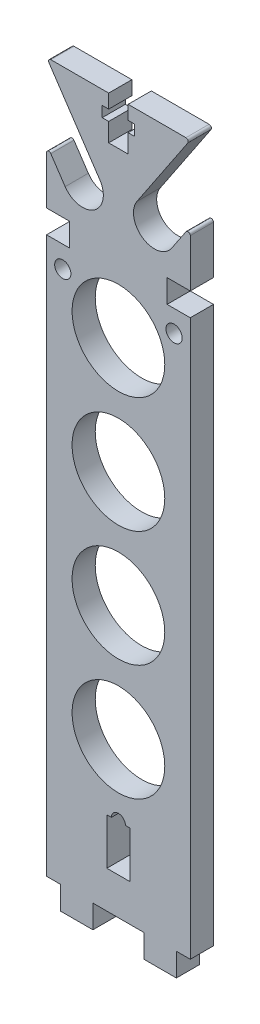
ISO-10303-21;
HEADER;
FILE_DESCRIPTION(('STEP AP214'),'2;1');
FILE_NAME('part.step','',(''),(''),'','','');
FILE_SCHEMA(('AUTOMOTIVE_DESIGN { 1 0 10303 214 1 1 1 1 }'));
ENDSEC;
DATA;
#1=APPLICATION_CONTEXT('core data for automotive mechanical design processes');
#2=APPLICATION_PROTOCOL_DEFINITION('international standard','automotive_design',2000,#1);
#3=PRODUCT_CONTEXT('',#1,'mechanical');
#4=PRODUCT('Part','Part','',(#3));
#5=PRODUCT_RELATED_PRODUCT_CATEGORY('part','',(#4));
#6=PRODUCT_DEFINITION_FORMATION('','',#4);
#7=PRODUCT_DEFINITION_CONTEXT('part definition',#1,'design');
#8=PRODUCT_DEFINITION('design','',#6,#7);
#9=PRODUCT_DEFINITION_SHAPE('','',#8);
#10=(LENGTH_UNIT() NAMED_UNIT(*) SI_UNIT(.MILLI.,.METRE.));
#11=(NAMED_UNIT(*) PLANE_ANGLE_UNIT() SI_UNIT($,.RADIAN.));
#12=(NAMED_UNIT(*) SI_UNIT($,.STERADIAN.) SOLID_ANGLE_UNIT());
#13=UNCERTAINTY_MEASURE_WITH_UNIT(LENGTH_MEASURE(1.E-05),#10,'distance_accuracy_value','');
#14=(GEOMETRIC_REPRESENTATION_CONTEXT(3) GLOBAL_UNCERTAINTY_ASSIGNED_CONTEXT((#13)) GLOBAL_UNIT_ASSIGNED_CONTEXT((#10,
#11,#12)) REPRESENTATION_CONTEXT('',''));
#15=CARTESIAN_POINT('',(0.,0.,0.));
#16=DIRECTION('',(0.,0.,1.));
#17=DIRECTION('',(1.,0.,0.));
#18=AXIS2_PLACEMENT_3D('',#15,#16,#17);
#19=CARTESIAN_POINT('',(15.5,153.,10.));
#20=DIRECTION('',(0.,-1.,0.));
#21=DIRECTION('',(0.,0.,-1.));
#22=AXIS2_PLACEMENT_3D('',#19,#20,#21);
#23=PLANE('',#22);
#24=DIRECTION('',(1.,0.,0.));
#25=VECTOR('',#24,1.);
#26=CARTESIAN_POINT('',(0.,153.,5.));
#27=LINE('',#26,#25);
#28=CARTESIAN_POINT('',(-14.5637034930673,153.,5.));
#29=VERTEX_POINT('',#28);
#30=CARTESIAN_POINT('',(-2.1,153.,5.));
#31=VERTEX_POINT('',#30);
#32=EDGE_CURVE('E519',#29,#31,#27,.T.);
#33=ORIENTED_EDGE('',*,*,#32,.T.);
#34=DIRECTION('',(0.,0.,1.));
#35=VECTOR('',#34,1.);
#36=CARTESIAN_POINT('',(-2.1,153.,0.));
#37=LINE('',#36,#35);
#38=CARTESIAN_POINT('',(-2.1,153.,0.));
#39=VERTEX_POINT('',#38);
#40=EDGE_CURVE('E431',#39,#31,#37,.T.);
#41=ORIENTED_EDGE('',*,*,#40,.F.);
#42=DIRECTION('',(-1.,0.,0.));
#43=VECTOR('',#42,1.);
#44=CARTESIAN_POINT('',(15.5,153.,0.));
#45=LINE('',#44,#43);
#46=CARTESIAN_POINT('',(-14.5637034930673,153.,0.));
#47=VERTEX_POINT('',#46);
#48=EDGE_CURVE('E514',#39,#47,#45,.T.);
#49=ORIENTED_EDGE('',*,*,#48,.T.);
#50=DIRECTION('',(0.,0.,-1.));
#51=VECTOR('',#50,1.);
#52=CARTESIAN_POINT('',(-14.5637034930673,153.,5.));
#53=LINE('',#52,#51);
#54=EDGE_CURVE('E688',#47,#29,#53,.F.);
#55=ORIENTED_EDGE('',*,*,#54,.T.);
#56=EDGE_LOOP('',(#33,#41,#49,#55));
#57=FACE_BOUND('',#56,.T.);
#58=ADVANCED_FACE('F35',(#57),#23,.F.);
#59=CARTESIAN_POINT('',(-15.5,170.,5.));
#60=DIRECTION('',(1.,0.,0.));
#61=DIRECTION('',(0.,1.,0.));
#62=AXIS2_PLACEMENT_3D('',#59,#60,#61);
#63=PLANE('',#62);
#64=DIRECTION('',(0.,0.,-1.));
#65=VECTOR('',#64,1.);
#66=CARTESIAN_POINT('',(-15.5,119.83,30.));
#67=LINE('',#66,#65);
#68=CARTESIAN_POINT('',(-15.5,119.83,5.));
#69=VERTEX_POINT('',#68);
#70=CARTESIAN_POINT('',(-15.5,119.83,0.));
#71=VERTEX_POINT('',#70);
#72=EDGE_CURVE('E455',#69,#71,#67,.T.);
#73=ORIENTED_EDGE('',*,*,#72,.T.);
#74=DIRECTION('',(0.,-1.,0.));
#75=VECTOR('',#74,1.);
#76=CARTESIAN_POINT('',(-15.5,170.,0.));
#77=LINE('',#76,#75);
#78=CARTESIAN_POINT('',(-15.5,0.,0.));
#79=VERTEX_POINT('',#78);
#80=EDGE_CURVE('E606',#71,#79,#77,.T.);
#81=ORIENTED_EDGE('',*,*,#80,.T.);
#82=DIRECTION('',(0.,0.,-1.));
#83=VECTOR('',#82,1.);
#84=CARTESIAN_POINT('',(-15.5,0.,5.));
#85=LINE('',#84,#83);
#86=CARTESIAN_POINT('',(-15.5,0.,5.));
#87=VERTEX_POINT('',#86);
#88=EDGE_CURVE('E685',#87,#79,#85,.T.);
#89=ORIENTED_EDGE('',*,*,#88,.F.);
#90=DIRECTION('',(0.,-1.,0.));
#91=VECTOR('',#90,1.);
#92=CARTESIAN_POINT('',(-15.5,170.,5.));
#93=LINE('',#92,#91);
#94=EDGE_CURVE('E611',#69,#87,#93,.T.);
#95=ORIENTED_EDGE('',*,*,#94,.F.);
#96=EDGE_LOOP('',(#73,#81,#89,#95));
#97=FACE_BOUND('',#96,.T.);
#98=ADVANCED_FACE('F754',(#97),#63,.F.);
#99=DIRECTION('',(0.,0.,-1.));
#100=VECTOR('',#99,1.);
#101=CARTESIAN_POINT('',(-15.5,124.83,30.));
#102=LINE('',#101,#100);
#103=CARTESIAN_POINT('',(-15.5,124.83,5.));
#104=VERTEX_POINT('',#103);
#105=CARTESIAN_POINT('',(-15.5,124.83,0.));
#106=VERTEX_POINT('',#105);
#107=EDGE_CURVE('E60',#104,#106,#102,.T.);
#108=ORIENTED_EDGE('',*,*,#107,.F.);
#109=CARTESIAN_POINT('',(-15.5,135.17296148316,5.));
#110=VERTEX_POINT('',#109);
#111=EDGE_CURVE('E607',#110,#104,#93,.T.);
#112=ORIENTED_EDGE('',*,*,#111,.F.);
#113=DIRECTION('',(0.,0.,-1.));
#114=VECTOR('',#113,1.);
#115=CARTESIAN_POINT('',(-15.5,135.17296148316,0.));
#116=LINE('',#115,#114);
#117=CARTESIAN_POINT('',(-15.5,135.17296148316,0.));
#118=VERTEX_POINT('',#117);
#119=EDGE_CURVE('E708',#110,#118,#116,.T.);
#120=ORIENTED_EDGE('',*,*,#119,.T.);
#121=EDGE_CURVE('E634',#118,#106,#77,.T.);
#122=ORIENTED_EDGE('',*,*,#121,.T.);
#123=EDGE_LOOP('',(#108,#112,#120,#122));
#124=FACE_BOUND('',#123,.T.);
#125=ADVANCED_FACE('F761',(#124),#63,.F.);
#126=CARTESIAN_POINT('',(0.,0.,5.));
#127=DIRECTION('',(0.,0.,1.));
#128=DIRECTION('',(1.,0.,0.));
#129=AXIS2_PLACEMENT_3D('',#126,#127,#128);
#130=PLANE('',#129);
#131=CARTESIAN_POINT('',(12.,115.151084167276,5.));
#132=DIRECTION('',(0.,0.,-1.));
#133=DIRECTION('',(-1.,0.,0.));
#134=AXIS2_PLACEMENT_3D('',#131,#132,#133);
#135=CIRCLE('',#134,1.75);
#136=CARTESIAN_POINT('',(10.25,115.151084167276,5.));
#137=VERTEX_POINT('',#136);
#138=EDGE_CURVE('E736',#137,#137,#135,.T.);
#139=ORIENTED_EDGE('',*,*,#138,.T.);
#140=EDGE_LOOP('',(#139));
#141=FACE_BOUND('',#140,.T.);
#142=CARTESIAN_POINT('',(-12.,115.151084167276,5.));
#143=DIRECTION('',(0.,0.,1.));
#144=DIRECTION('',(1.,0.,0.));
#145=AXIS2_PLACEMENT_3D('',#142,#143,#144);
#146=CIRCLE('',#145,1.75);
#147=CARTESIAN_POINT('',(-10.25,115.151084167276,5.));
#148=VERTEX_POINT('',#147);
#149=EDGE_CURVE('E376',#148,#148,#146,.T.);
#150=ORIENTED_EDGE('',*,*,#149,.F.);
#151=EDGE_LOOP('',(#150));
#152=FACE_BOUND('',#151,.T.);
#153=DIRECTION('',(0.,-1.,0.));
#154=VECTOR('',#153,1.);
#155=CARTESIAN_POINT('',(-2.1,153.,5.));
#156=LINE('',#155,#154);
#157=CARTESIAN_POINT('',(-2.1,150.,5.));
#158=VERTEX_POINT('',#157);
#159=EDGE_CURVE('E373',#31,#158,#156,.T.);
#160=ORIENTED_EDGE('',*,*,#159,.F.);
#161=ORIENTED_EDGE('',*,*,#32,.F.);
#162=CARTESIAN_POINT('',(-14.5637034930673,152.5,5.));
#163=DIRECTION('',(0.,0.,1.));
#164=DIRECTION('',(1.,0.,0.));
#165=AXIS2_PLACEMENT_3D('',#162,#163,#164);
#166=CIRCLE('',#165,0.5);
#167=CARTESIAN_POINT('',(-14.9792254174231,152.221896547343,5.));
#168=VERTEX_POINT('',#167);
#169=EDGE_CURVE('E700',#29,#168,#166,.T.);
#170=ORIENTED_EDGE('',*,*,#169,.T.);
#171=DIRECTION('',(0.556206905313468,-0.831043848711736,0.));
#172=VECTOR('',#171,1.);
#173=CARTESIAN_POINT('',(60.0167209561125,40.1684155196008,5.));
#174=LINE('',#173,#172);
#175=CARTESIAN_POINT('',(-4.0103026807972,135.832931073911,5.));
#176=VERTEX_POINT('',#175);
#177=EDGE_CURVE('E538',#168,#176,#174,.T.);
#178=ORIENTED_EDGE('',*,*,#177,.T.);
#179=CARTESIAN_POINT('',(-7.75000000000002,133.33,5.));
#180=DIRECTION('',(0.,0.,1.));
#181=DIRECTION('',(1.,0.,0.));
#182=AXIS2_PLACEMENT_3D('',#179,#180,#181);
#183=CIRCLE('',#182,4.5);
#184=CARTESIAN_POINT('',(-11.4896973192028,130.827068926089,5.));
#185=VERTEX_POINT('',#184);
#186=EDGE_CURVE('E540',#176,#185,#183,.F.);
#187=ORIENTED_EDGE('',*,*,#186,.T.);
#188=DIRECTION('',(-0.556206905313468,0.831043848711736,0.));
#189=VECTOR('',#188,1.);
#190=CARTESIAN_POINT('',(52.5373263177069,35.1625533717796,5.));
#191=LINE('',#190,#189);
#192=CARTESIAN_POINT('',(-14.5844780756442,135.451064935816,5.));
#193=VERTEX_POINT('',#192);
#194=EDGE_CURVE('E533',#185,#193,#191,.T.);
#195=ORIENTED_EDGE('',*,*,#194,.T.);
#196=CARTESIAN_POINT('',(-15.,135.17296148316,5.));
#197=DIRECTION('',(0.,0.,1.));
#198=DIRECTION('',(1.,0.,0.));
#199=AXIS2_PLACEMENT_3D('',#196,#197,#198);
#200=CIRCLE('',#199,0.5);
#201=EDGE_CURVE('E720',#193,#110,#200,.T.);
#202=ORIENTED_EDGE('',*,*,#201,.T.);
#203=ORIENTED_EDGE('',*,*,#111,.T.);
#204=DIRECTION('',(1.,0.,0.));
#205=VECTOR('',#204,1.);
#206=CARTESIAN_POINT('',(0.,124.83,5.));
#207=LINE('',#206,#205);
#208=CARTESIAN_POINT('',(-10.5,124.83,5.));
#209=VERTEX_POINT('',#208);
#210=EDGE_CURVE('E458',#104,#209,#207,.T.);
#211=ORIENTED_EDGE('',*,*,#210,.T.);
#212=DIRECTION('',(0.,-1.,0.));
#213=VECTOR('',#212,1.);
#214=CARTESIAN_POINT('',(-10.5,0.,5.));
#215=LINE('',#214,#213);
#216=CARTESIAN_POINT('',(-10.5,119.83,5.));
#217=VERTEX_POINT('',#216);
#218=EDGE_CURVE('E466',#209,#217,#215,.T.);
#219=ORIENTED_EDGE('',*,*,#218,.T.);
#220=DIRECTION('',(-1.,0.,0.));
#221=VECTOR('',#220,1.);
#222=CARTESIAN_POINT('',(0.,119.83,5.));
#223=LINE('',#222,#221);
#224=EDGE_CURVE('E469',#217,#69,#223,.T.);
#225=ORIENTED_EDGE('',*,*,#224,.T.);
#226=ORIENTED_EDGE('',*,*,#94,.T.);
#227=DIRECTION('',(1.,0.,0.));
#228=VECTOR('',#227,1.);
#229=CARTESIAN_POINT('',(-15.5,0.,5.));
#230=LINE('',#229,#228);
#231=CARTESIAN_POINT('',(-12.5,0.,5.));
#232=VERTEX_POINT('',#231);
#233=EDGE_CURVE('E610',#87,#232,#230,.T.);
#234=ORIENTED_EDGE('',*,*,#233,.T.);
#235=DIRECTION('',(0.,-1.,0.));
#236=VECTOR('',#235,1.);
#237=CARTESIAN_POINT('',(-12.5,0.,5.));
#238=LINE('',#237,#236);
#239=CARTESIAN_POINT('',(-12.5,-5.,5.));
#240=VERTEX_POINT('',#239);
#241=EDGE_CURVE('E613',#232,#240,#238,.T.);
#242=ORIENTED_EDGE('',*,*,#241,.T.);
#243=DIRECTION('',(1.,0.,0.));
#244=VECTOR('',#243,1.);
#245=CARTESIAN_POINT('',(-12.5,-5.,5.));
#246=LINE('',#245,#244);
#247=CARTESIAN_POINT('',(-5.5,-5.,5.));
#248=VERTEX_POINT('',#247);
#249=EDGE_CURVE('E615',#240,#248,#246,.T.);
#250=ORIENTED_EDGE('',*,*,#249,.T.);
#251=DIRECTION('',(0.,1.,0.));
#252=VECTOR('',#251,1.);
#253=CARTESIAN_POINT('',(-5.5,-5.,5.));
#254=LINE('',#253,#252);
#255=CARTESIAN_POINT('',(-5.5,0.,5.));
#256=VERTEX_POINT('',#255);
#257=EDGE_CURVE('E617',#248,#256,#254,.T.);
#258=ORIENTED_EDGE('',*,*,#257,.T.);
#259=DIRECTION('',(1.,0.,0.));
#260=VECTOR('',#259,1.);
#261=CARTESIAN_POINT('',(-5.5,0.,5.));
#262=LINE('',#261,#260);
#263=CARTESIAN_POINT('',(5.5,0.,5.));
#264=VERTEX_POINT('',#263);
#265=EDGE_CURVE('E619',#256,#264,#262,.T.);
#266=ORIENTED_EDGE('',*,*,#265,.T.);
#267=DIRECTION('',(0.,-1.,0.));
#268=VECTOR('',#267,1.);
#269=CARTESIAN_POINT('',(5.5,0.,5.));
#270=LINE('',#269,#268);
#271=CARTESIAN_POINT('',(5.5,-5.,5.));
#272=VERTEX_POINT('',#271);
#273=EDGE_CURVE('E621',#264,#272,#270,.T.);
#274=ORIENTED_EDGE('',*,*,#273,.T.);
#275=DIRECTION('',(1.,0.,0.));
#276=VECTOR('',#275,1.);
#277=CARTESIAN_POINT('',(5.5,-5.,5.));
#278=LINE('',#277,#276);
#279=CARTESIAN_POINT('',(12.5,-5.,5.));
#280=VERTEX_POINT('',#279);
#281=EDGE_CURVE('E623',#272,#280,#278,.T.);
#282=ORIENTED_EDGE('',*,*,#281,.T.);
#283=DIRECTION('',(0.,1.,0.));
#284=VECTOR('',#283,1.);
#285=CARTESIAN_POINT('',(12.5,-5.,5.));
#286=LINE('',#285,#284);
#287=CARTESIAN_POINT('',(12.5,0.,5.));
#288=VERTEX_POINT('',#287);
#289=EDGE_CURVE('E625',#280,#288,#286,.T.);
#290=ORIENTED_EDGE('',*,*,#289,.T.);
#291=DIRECTION('',(1.,0.,0.));
#292=VECTOR('',#291,1.);
#293=CARTESIAN_POINT('',(12.5,0.,5.));
#294=LINE('',#293,#292);
#295=CARTESIAN_POINT('',(15.5,0.,5.));
#296=VERTEX_POINT('',#295);
#297=EDGE_CURVE('E627',#288,#296,#294,.T.);
#298=ORIENTED_EDGE('',*,*,#297,.T.);
#299=DIRECTION('',(0.,1.,0.));
#300=VECTOR('',#299,1.);
#301=CARTESIAN_POINT('',(15.5,0.,5.));
#302=LINE('',#301,#300);
#303=CARTESIAN_POINT('',(15.5,119.83,5.));
#304=VERTEX_POINT('',#303);
#305=EDGE_CURVE('E630',#296,#304,#302,.T.);
#306=ORIENTED_EDGE('',*,*,#305,.T.);
#307=DIRECTION('',(1.,0.,0.));
#308=VECTOR('',#307,1.);
#309=CARTESIAN_POINT('',(0.,119.83,5.));
#310=LINE('',#309,#308);
#311=CARTESIAN_POINT('',(10.5,119.83,5.));
#312=VERTEX_POINT('',#311);
#313=EDGE_CURVE('E483',#312,#304,#310,.T.);
#314=ORIENTED_EDGE('',*,*,#313,.F.);
#315=DIRECTION('',(0.,-1.,0.));
#316=VECTOR('',#315,1.);
#317=CARTESIAN_POINT('',(10.5,0.,5.));
#318=LINE('',#317,#316);
#319=CARTESIAN_POINT('',(10.5,124.83,5.));
#320=VERTEX_POINT('',#319);
#321=EDGE_CURVE('E488',#320,#312,#318,.T.);
#322=ORIENTED_EDGE('',*,*,#321,.F.);
#323=DIRECTION('',(-1.,0.,0.));
#324=VECTOR('',#323,1.);
#325=CARTESIAN_POINT('',(0.,124.83,5.));
#326=LINE('',#325,#324);
#327=CARTESIAN_POINT('',(15.5,124.83,5.));
#328=VERTEX_POINT('',#327);
#329=EDGE_CURVE('E486',#328,#320,#326,.T.);
#330=ORIENTED_EDGE('',*,*,#329,.F.);
#331=CARTESIAN_POINT('',(15.5,135.172961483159,5.));
#332=VERTEX_POINT('',#331);
#333=EDGE_CURVE('E629',#328,#332,#302,.T.);
#334=ORIENTED_EDGE('',*,*,#333,.T.);
#335=CARTESIAN_POINT('',(15.,135.172961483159,5.));
#336=DIRECTION('',(0.,0.,1.));
#337=DIRECTION('',(1.,0.,0.));
#338=AXIS2_PLACEMENT_3D('',#335,#336,#337);
#339=CIRCLE('',#338,0.5);
#340=CARTESIAN_POINT('',(14.5844780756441,135.451064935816,5.));
#341=VERTEX_POINT('',#340);
#342=EDGE_CURVE('E718',#332,#341,#339,.T.);
#343=ORIENTED_EDGE('',*,*,#342,.T.);
#344=DIRECTION('',(0.556206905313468,0.831043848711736,0.));
#345=VECTOR('',#344,1.);
#346=CARTESIAN_POINT('',(-52.5373263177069,35.1625533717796,5.));
#347=LINE('',#346,#345);
#348=CARTESIAN_POINT('',(11.4896973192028,130.827068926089,5.));
#349=VERTEX_POINT('',#348);
#350=EDGE_CURVE('E558',#349,#341,#347,.T.);
#351=ORIENTED_EDGE('',*,*,#350,.F.);
#352=CARTESIAN_POINT('',(7.75000000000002,133.33,5.));
#353=DIRECTION('',(0.,0.,1.));
#354=DIRECTION('',(1.,0.,0.));
#355=AXIS2_PLACEMENT_3D('',#352,#353,#354);
#356=CIRCLE('',#355,4.5);
#357=CARTESIAN_POINT('',(4.0103026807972,135.832931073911,5.));
#358=VERTEX_POINT('',#357);
#359=EDGE_CURVE('E561',#358,#349,#356,.T.);
#360=ORIENTED_EDGE('',*,*,#359,.F.);
#361=DIRECTION('',(-0.556206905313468,-0.831043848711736,0.));
#362=VECTOR('',#361,1.);
#363=CARTESIAN_POINT('',(-60.0167209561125,40.1684155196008,5.));
#364=LINE('',#363,#362);
#365=CARTESIAN_POINT('',(14.9792254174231,152.221896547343,5.));
#366=VERTEX_POINT('',#365);
#367=EDGE_CURVE('E554',#366,#358,#364,.T.);
#368=ORIENTED_EDGE('',*,*,#367,.F.);
#369=CARTESIAN_POINT('',(14.5637034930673,152.5,5.));
#370=DIRECTION('',(0.,0.,1.));
#371=DIRECTION('',(1.,0.,0.));
#372=AXIS2_PLACEMENT_3D('',#369,#370,#371);
#373=CIRCLE('',#372,0.5);
#374=CARTESIAN_POINT('',(14.5637034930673,153.,5.));
#375=VERTEX_POINT('',#374);
#376=EDGE_CURVE('E702',#366,#375,#373,.T.);
#377=ORIENTED_EDGE('',*,*,#376,.T.);
#378=CARTESIAN_POINT('',(2.1,153.,5.));
#379=VERTEX_POINT('',#378);
#380=EDGE_CURVE('E518',#379,#375,#27,.T.);
#381=ORIENTED_EDGE('',*,*,#380,.F.);
#382=DIRECTION('',(0.,1.,0.));
#383=VECTOR('',#382,1.);
#384=CARTESIAN_POINT('',(2.1,153.,5.));
#385=LINE('',#384,#383);
#386=CARTESIAN_POINT('',(2.1,150.,5.));
#387=VERTEX_POINT('',#386);
#388=EDGE_CURVE('E52',#387,#379,#385,.T.);
#389=ORIENTED_EDGE('',*,*,#388,.F.);
#390=DIRECTION('',(-1.,0.,0.));
#391=VECTOR('',#390,1.);
#392=CARTESIAN_POINT('',(2.1,150.,5.));
#393=LINE('',#392,#391);
#394=CARTESIAN_POINT('',(3.5,150.,5.));
#395=VERTEX_POINT('',#394);
#396=EDGE_CURVE('E420',#395,#387,#393,.T.);
#397=ORIENTED_EDGE('',*,*,#396,.F.);
#398=DIRECTION('',(0.,1.,0.));
#399=VECTOR('',#398,1.);
#400=CARTESIAN_POINT('',(3.5,150.,5.));
#401=LINE('',#400,#399);
#402=CARTESIAN_POINT('',(3.5,147.7,5.));
#403=VERTEX_POINT('',#402);
#404=EDGE_CURVE('E417',#403,#395,#401,.T.);
#405=ORIENTED_EDGE('',*,*,#404,.F.);
#406=DIRECTION('',(1.,0.,0.));
#407=VECTOR('',#406,1.);
#408=CARTESIAN_POINT('',(2.1,147.7,5.));
#409=LINE('',#408,#407);
#410=CARTESIAN_POINT('',(2.1,147.7,5.));
#411=VERTEX_POINT('',#410);
#412=EDGE_CURVE('E414',#411,#403,#409,.T.);
#413=ORIENTED_EDGE('',*,*,#412,.F.);
#414=DIRECTION('',(0.,1.,0.));
#415=VECTOR('',#414,1.);
#416=CARTESIAN_POINT('',(2.1,143.7,5.));
#417=LINE('',#416,#415);
#418=CARTESIAN_POINT('',(2.1,143.7,5.));
#419=VERTEX_POINT('',#418);
#420=EDGE_CURVE('E411',#419,#411,#417,.T.);
#421=ORIENTED_EDGE('',*,*,#420,.F.);
#422=DIRECTION('',(1.,0.,0.));
#423=VECTOR('',#422,1.);
#424=CARTESIAN_POINT('',(-2.1,143.7,5.));
#425=LINE('',#424,#423);
#426=CARTESIAN_POINT('',(-2.1,143.7,5.));
#427=VERTEX_POINT('',#426);
#428=EDGE_CURVE('E408',#427,#419,#425,.T.);
#429=ORIENTED_EDGE('',*,*,#428,.F.);
#430=DIRECTION('',(0.,-1.,0.));
#431=VECTOR('',#430,1.);
#432=CARTESIAN_POINT('',(-2.1,147.7,5.));
#433=LINE('',#432,#431);
#434=CARTESIAN_POINT('',(-2.1,147.7,5.));
#435=VERTEX_POINT('',#434);
#436=EDGE_CURVE('E405',#435,#427,#433,.T.);
#437=ORIENTED_EDGE('',*,*,#436,.F.);
#438=DIRECTION('',(1.,0.,0.));
#439=VECTOR('',#438,1.);
#440=CARTESIAN_POINT('',(-3.5,147.7,5.));
#441=LINE('',#440,#439);
#442=CARTESIAN_POINT('',(-3.5,147.7,5.));
#443=VERTEX_POINT('',#442);
#444=EDGE_CURVE('E402',#443,#435,#441,.T.);
#445=ORIENTED_EDGE('',*,*,#444,.F.);
#446=DIRECTION('',(0.,-1.,0.));
#447=VECTOR('',#446,1.);
#448=CARTESIAN_POINT('',(-3.5,150.,5.));
#449=LINE('',#448,#447);
#450=CARTESIAN_POINT('',(-3.5,150.,5.));
#451=VERTEX_POINT('',#450);
#452=EDGE_CURVE('E350',#451,#443,#449,.T.);
#453=ORIENTED_EDGE('',*,*,#452,.F.);
#454=DIRECTION('',(-1.,0.,0.));
#455=VECTOR('',#454,1.);
#456=CARTESIAN_POINT('',(-3.5,150.,5.));
#457=LINE('',#456,#455);
#458=EDGE_CURVE('E370',#158,#451,#457,.T.);
#459=ORIENTED_EDGE('',*,*,#458,.F.);
#460=EDGE_LOOP('',(#160,#161,#170,#178,#187,#195,#202,#203,#211,#219,#225,#226,#234,#242,#250,
#258,#266,#274,#282,#290,#298,#306,#314,#322,#330,#334,#343,#351,#360,#368,#377,#381,#389,#397,
#405,#413,#421,#429,#437,#445,#453,#459));
#461=FACE_BOUND('',#460,.T.);
#462=CARTESIAN_POINT('',(0.,108.33,5.));
#463=DIRECTION('',(0.,0.,1.));
#464=DIRECTION('',(1.,0.,0.));
#465=AXIS2_PLACEMENT_3D('',#462,#463,#464);
#466=CIRCLE('',#465,10.);
#467=CARTESIAN_POINT('',(10.,108.33,5.));
#468=VERTEX_POINT('',#467);
#469=EDGE_CURVE('E511',#468,#468,#466,.T.);
#470=ORIENTED_EDGE('',*,*,#469,.F.);
#471=EDGE_LOOP('',(#470));
#472=FACE_BOUND('',#471,.T.);
#473=CARTESIAN_POINT('',(0.,83.33,5.));
#474=DIRECTION('',(0.,0.,1.));
#475=DIRECTION('',(1.,0.,0.));
#476=AXIS2_PLACEMENT_3D('',#473,#474,#475);
#477=CIRCLE('',#476,10.);
#478=CARTESIAN_POINT('',(10.,83.33,5.));
#479=VERTEX_POINT('',#478);
#480=EDGE_CURVE('E508',#479,#479,#477,.T.);
#481=ORIENTED_EDGE('',*,*,#480,.F.);
#482=EDGE_LOOP('',(#481));
#483=FACE_BOUND('',#482,.T.);
#484=CARTESIAN_POINT('',(0.,58.33,5.));
#485=DIRECTION('',(0.,0.,1.));
#486=DIRECTION('',(1.,0.,0.));
#487=AXIS2_PLACEMENT_3D('',#484,#485,#486);
#488=CIRCLE('',#487,10.);
#489=CARTESIAN_POINT('',(10.,58.33,5.));
#490=VERTEX_POINT('',#489);
#491=EDGE_CURVE('E505',#490,#490,#488,.T.);
#492=ORIENTED_EDGE('',*,*,#491,.F.);
#493=EDGE_LOOP('',(#492));
#494=FACE_BOUND('',#493,.T.);
#495=CARTESIAN_POINT('',(0.,33.33,5.));
#496=DIRECTION('',(0.,0.,1.));
#497=DIRECTION('',(1.,0.,0.));
#498=AXIS2_PLACEMENT_3D('',#495,#496,#497);
#499=CIRCLE('',#498,10.);
#500=CARTESIAN_POINT('',(10.,33.33,5.));
#501=VERTEX_POINT('',#500);
#502=EDGE_CURVE('E494',#501,#501,#499,.T.);
#503=ORIENTED_EDGE('',*,*,#502,.F.);
#504=EDGE_LOOP('',(#503));
#505=FACE_BOUND('',#504,.T.);
#506=DIRECTION('',(0.,1.,0.));
#507=VECTOR('',#506,1.);
#508=CARTESIAN_POINT('',(2.5,0.,5.));
#509=LINE('',#508,#507);
#510=CARTESIAN_POINT('',(2.5,8.,5.));
#511=VERTEX_POINT('',#510);
#512=CARTESIAN_POINT('',(2.5,18.,5.));
#513=VERTEX_POINT('',#512);
#514=EDGE_CURVE('E604',#511,#513,#509,.T.);
#515=ORIENTED_EDGE('',*,*,#514,.F.);
#516=DIRECTION('',(1.,0.,0.));
#517=VECTOR('',#516,1.);
#518=CARTESIAN_POINT('',(0.,8.,5.));
#519=LINE('',#518,#517);
#520=CARTESIAN_POINT('',(-2.50000000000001,8.,5.));
#521=VERTEX_POINT('',#520);
#522=EDGE_CURVE('E583',#521,#511,#519,.T.);
#523=ORIENTED_EDGE('',*,*,#522,.F.);
#524=DIRECTION('',(0.,-1.,0.));
#525=VECTOR('',#524,1.);
#526=CARTESIAN_POINT('',(-2.50000000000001,0.,5.));
#527=LINE('',#526,#525);
#528=CARTESIAN_POINT('',(-2.5,18.,5.));
#529=VERTEX_POINT('',#528);
#530=EDGE_CURVE('E595',#529,#521,#527,.T.);
#531=ORIENTED_EDGE('',*,*,#530,.F.);
#532=DIRECTION('',(-1.,0.,0.));
#533=VECTOR('',#532,1.);
#534=CARTESIAN_POINT('',(0.,18.,5.));
#535=LINE('',#534,#533);
#536=CARTESIAN_POINT('',(-1.50937464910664,18.,5.));
#537=VERTEX_POINT('',#536);
#538=EDGE_CURVE('E598',#537,#529,#535,.T.);
#539=ORIENTED_EDGE('',*,*,#538,.F.);
#540=CARTESIAN_POINT('',(0.,18.,5.));
#541=DIRECTION('',(0.,0.,1.));
#542=DIRECTION('',(1.,0.,0.));
#543=AXIS2_PLACEMENT_3D('',#540,#541,#542);
#544=CIRCLE('',#543,1.50937464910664);
#545=CARTESIAN_POINT('',(1.50937464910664,18.,5.));
#546=VERTEX_POINT('',#545);
#547=EDGE_CURVE('E600',#546,#537,#544,.T.);
#548=ORIENTED_EDGE('',*,*,#547,.F.);
#549=DIRECTION('',(-1.,0.,0.));
#550=VECTOR('',#549,1.);
#551=CARTESIAN_POINT('',(0.,18.,5.));
#552=LINE('',#551,#550);
#553=EDGE_CURVE('E602',#513,#546,#552,.T.);
#554=ORIENTED_EDGE('',*,*,#553,.F.);
#555=EDGE_LOOP('',(#515,#523,#531,#539,#548,#554));
#556=FACE_BOUND('',#555,.T.);
#557=ADVANCED_FACE('F742',(#141,#152,#461,#472,#483,#494,#505,#556),#130,.T.);
#558=CARTESIAN_POINT('',(0.,0.,0.));
#559=DIRECTION('',(0.,0.,1.));
#560=DIRECTION('',(1.,0.,0.));
#561=AXIS2_PLACEMENT_3D('',#558,#559,#560);
#562=PLANE('',#561);
#563=CARTESIAN_POINT('',(12.,115.151084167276,0.));
#564=DIRECTION('',(0.,0.,1.));
#565=DIRECTION('',(1.,0.,0.));
#566=AXIS2_PLACEMENT_3D('',#563,#564,#565);
#567=CIRCLE('',#566,1.75);
#568=CARTESIAN_POINT('',(13.75,115.151084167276,0.));
#569=VERTEX_POINT('',#568);
#570=EDGE_CURVE('E39',#569,#569,#567,.F.);
#571=ORIENTED_EDGE('',*,*,#570,.F.);
#572=EDGE_LOOP('',(#571));
#573=FACE_BOUND('',#572,.T.);
#574=CARTESIAN_POINT('',(-12.,115.151084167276,0.));
#575=DIRECTION('',(0.,0.,1.));
#576=DIRECTION('',(1.,0.,0.));
#577=AXIS2_PLACEMENT_3D('',#574,#575,#576);
#578=CIRCLE('',#577,1.75);
#579=CARTESIAN_POINT('',(-10.25,115.151084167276,0.));
#580=VERTEX_POINT('',#579);
#581=EDGE_CURVE('E403',#580,#580,#578,.T.);
#582=ORIENTED_EDGE('',*,*,#581,.T.);
#583=EDGE_LOOP('',(#582));
#584=FACE_BOUND('',#583,.T.);
#585=ORIENTED_EDGE('',*,*,#48,.F.);
#586=DIRECTION('',(0.,-1.,0.));
#587=VECTOR('',#586,1.);
#588=CARTESIAN_POINT('',(-2.1,153.,0.));
#589=LINE('',#588,#587);
#590=CARTESIAN_POINT('',(-2.1,150.,0.));
#591=VERTEX_POINT('',#590);
#592=EDGE_CURVE('E398',#39,#591,#589,.T.);
#593=ORIENTED_EDGE('',*,*,#592,.T.);
#594=DIRECTION('',(-1.,0.,0.));
#595=VECTOR('',#594,1.);
#596=CARTESIAN_POINT('',(-3.5,150.,0.));
#597=LINE('',#596,#595);
#598=CARTESIAN_POINT('',(-3.5,150.,0.));
#599=VERTEX_POINT('',#598);
#600=EDGE_CURVE('E355',#591,#599,#597,.T.);
#601=ORIENTED_EDGE('',*,*,#600,.T.);
#602=DIRECTION('',(0.,-1.,0.));
#603=VECTOR('',#602,1.);
#604=CARTESIAN_POINT('',(-3.5,150.,0.));
#605=LINE('',#604,#603);
#606=CARTESIAN_POINT('',(-3.5,147.7,0.));
#607=VERTEX_POINT('',#606);
#608=EDGE_CURVE('E347',#599,#607,#605,.T.);
#609=ORIENTED_EDGE('',*,*,#608,.T.);
#610=DIRECTION('',(1.,0.,0.));
#611=VECTOR('',#610,1.);
#612=CARTESIAN_POINT('',(-3.5,147.7,0.));
#613=LINE('',#612,#611);
#614=CARTESIAN_POINT('',(-2.1,147.7,0.));
#615=VERTEX_POINT('',#614);
#616=EDGE_CURVE('E358',#607,#615,#613,.T.);
#617=ORIENTED_EDGE('',*,*,#616,.T.);
#618=DIRECTION('',(0.,-1.,0.));
#619=VECTOR('',#618,1.);
#620=CARTESIAN_POINT('',(-2.1,147.7,0.));
#621=LINE('',#620,#619);
#622=CARTESIAN_POINT('',(-2.1,143.7,0.));
#623=VERTEX_POINT('',#622);
#624=EDGE_CURVE('E363',#615,#623,#621,.T.);
#625=ORIENTED_EDGE('',*,*,#624,.T.);
#626=DIRECTION('',(1.,0.,0.));
#627=VECTOR('',#626,1.);
#628=CARTESIAN_POINT('',(-2.1,143.7,0.));
#629=LINE('',#628,#627);
#630=CARTESIAN_POINT('',(2.1,143.7,0.));
#631=VERTEX_POINT('',#630);
#632=EDGE_CURVE('E380',#623,#631,#629,.T.);
#633=ORIENTED_EDGE('',*,*,#632,.T.);
#634=DIRECTION('',(0.,1.,0.));
#635=VECTOR('',#634,1.);
#636=CARTESIAN_POINT('',(2.1,143.7,0.));
#637=LINE('',#636,#635);
#638=CARTESIAN_POINT('',(2.1,147.7,0.));
#639=VERTEX_POINT('',#638);
#640=EDGE_CURVE('E383',#631,#639,#637,.T.);
#641=ORIENTED_EDGE('',*,*,#640,.T.);
#642=DIRECTION('',(1.,0.,0.));
#643=VECTOR('',#642,1.);
#644=CARTESIAN_POINT('',(2.1,147.7,0.));
#645=LINE('',#644,#643);
#646=CARTESIAN_POINT('',(3.5,147.7,0.));
#647=VERTEX_POINT('',#646);
#648=EDGE_CURVE('E386',#639,#647,#645,.T.);
#649=ORIENTED_EDGE('',*,*,#648,.T.);
#650=DIRECTION('',(0.,1.,0.));
#651=VECTOR('',#650,1.);
#652=CARTESIAN_POINT('',(3.5,150.,0.));
#653=LINE('',#652,#651);
#654=CARTESIAN_POINT('',(3.5,150.,0.));
#655=VERTEX_POINT('',#654);
#656=EDGE_CURVE('E389',#647,#655,#653,.T.);
#657=ORIENTED_EDGE('',*,*,#656,.T.);
#658=DIRECTION('',(-1.,0.,0.));
#659=VECTOR('',#658,1.);
#660=CARTESIAN_POINT('',(2.1,150.,0.));
#661=LINE('',#660,#659);
#662=CARTESIAN_POINT('',(2.1,150.,0.));
#663=VERTEX_POINT('',#662);
#664=EDGE_CURVE('E392',#655,#663,#661,.T.);
#665=ORIENTED_EDGE('',*,*,#664,.T.);
#666=DIRECTION('',(0.,1.,0.));
#667=VECTOR('',#666,1.);
#668=CARTESIAN_POINT('',(2.1,153.,0.));
#669=LINE('',#668,#667);
#670=CARTESIAN_POINT('',(2.1,153.,0.));
#671=VERTEX_POINT('',#670);
#672=EDGE_CURVE('E395',#663,#671,#669,.T.);
#673=ORIENTED_EDGE('',*,*,#672,.T.);
#674=CARTESIAN_POINT('',(14.5637034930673,153.,0.));
#675=VERTEX_POINT('',#674);
#676=EDGE_CURVE('E515',#675,#671,#45,.T.);
#677=ORIENTED_EDGE('',*,*,#676,.F.);
#678=CARTESIAN_POINT('',(14.5637034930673,152.5,0.));
#679=DIRECTION('',(0.,0.,1.));
#680=DIRECTION('',(1.,0.,0.));
#681=AXIS2_PLACEMENT_3D('',#678,#679,#680);
#682=CIRCLE('',#681,0.5);
#683=CARTESIAN_POINT('',(14.9792254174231,152.221896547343,0.));
#684=VERTEX_POINT('',#683);
#685=EDGE_CURVE('E696',#675,#684,#682,.F.);
#686=ORIENTED_EDGE('',*,*,#685,.T.);
#687=DIRECTION('',(0.556206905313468,0.831043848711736,0.));
#688=VECTOR('',#687,1.);
#689=CARTESIAN_POINT('',(4.0103026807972,135.832931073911,0.));
#690=LINE('',#689,#688);
#691=CARTESIAN_POINT('',(4.0103026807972,135.832931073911,0.));
#692=VERTEX_POINT('',#691);
#693=EDGE_CURVE('E545',#692,#684,#690,.T.);
#694=ORIENTED_EDGE('',*,*,#693,.F.);
#695=CARTESIAN_POINT('',(7.75000000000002,133.33,0.));
#696=DIRECTION('',(0.,0.,-1.));
#697=DIRECTION('',(-1.,0.,0.));
#698=AXIS2_PLACEMENT_3D('',#695,#696,#697);
#699=CIRCLE('',#698,4.5);
#700=CARTESIAN_POINT('',(11.4896973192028,130.827068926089,0.));
#701=VERTEX_POINT('',#700);
#702=EDGE_CURVE('E543',#701,#692,#699,.T.);
#703=ORIENTED_EDGE('',*,*,#702,.F.);
#704=DIRECTION('',(-0.556206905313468,-0.831043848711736,0.));
#705=VECTOR('',#704,1.);
#706=CARTESIAN_POINT('',(11.4896973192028,130.827068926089,0.));
#707=LINE('',#706,#705);
#708=CARTESIAN_POINT('',(14.5844780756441,135.451064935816,0.));
#709=VERTEX_POINT('',#708);
#710=EDGE_CURVE('E548',#709,#701,#707,.T.);
#711=ORIENTED_EDGE('',*,*,#710,.F.);
#712=CARTESIAN_POINT('',(15.,135.172961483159,0.));
#713=DIRECTION('',(0.,0.,1.));
#714=DIRECTION('',(1.,0.,0.));
#715=AXIS2_PLACEMENT_3D('',#712,#713,#714);
#716=CIRCLE('',#715,0.5);
#717=CARTESIAN_POINT('',(15.5,135.172961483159,0.));
#718=VERTEX_POINT('',#717);
#719=EDGE_CURVE('E711',#709,#718,#716,.F.);
#720=ORIENTED_EDGE('',*,*,#719,.T.);
#721=DIRECTION('',(0.,1.,0.));
#722=VECTOR('',#721,1.);
#723=CARTESIAN_POINT('',(15.5,0.,0.));
#724=LINE('',#723,#722);
#725=CARTESIAN_POINT('',(15.5,124.83,0.));
#726=VERTEX_POINT('',#725);
#727=EDGE_CURVE('E655',#726,#718,#724,.T.);
#728=ORIENTED_EDGE('',*,*,#727,.F.);
#729=DIRECTION('',(1.,0.,0.));
#730=VECTOR('',#729,1.);
#731=CARTESIAN_POINT('',(15.5,124.83,0.));
#732=LINE('',#731,#730);
#733=CARTESIAN_POINT('',(10.5,124.83,0.));
#734=VERTEX_POINT('',#733);
#735=EDGE_CURVE('E478',#734,#726,#732,.T.);
#736=ORIENTED_EDGE('',*,*,#735,.F.);
#737=DIRECTION('',(0.,1.,0.));
#738=VECTOR('',#737,1.);
#739=CARTESIAN_POINT('',(10.5,124.83,0.));
#740=LINE('',#739,#738);
#741=CARTESIAN_POINT('',(10.5,119.83,0.));
#742=VERTEX_POINT('',#741);
#743=EDGE_CURVE('E475',#742,#734,#740,.T.);
#744=ORIENTED_EDGE('',*,*,#743,.F.);
#745=DIRECTION('',(-1.,0.,0.));
#746=VECTOR('',#745,1.);
#747=CARTESIAN_POINT('',(15.5,119.83,0.));
#748=LINE('',#747,#746);
#749=CARTESIAN_POINT('',(15.5,119.83,0.));
#750=VERTEX_POINT('',#749);
#751=EDGE_CURVE('E472',#750,#742,#748,.T.);
#752=ORIENTED_EDGE('',*,*,#751,.F.);
#753=CARTESIAN_POINT('',(15.5,0.,0.));
#754=VERTEX_POINT('',#753);
#755=EDGE_CURVE('E656',#754,#750,#724,.T.);
#756=ORIENTED_EDGE('',*,*,#755,.F.);
#757=DIRECTION('',(1.,0.,0.));
#758=VECTOR('',#757,1.);
#759=CARTESIAN_POINT('',(12.5,0.,0.));
#760=LINE('',#759,#758);
#761=CARTESIAN_POINT('',(12.5,0.,0.));
#762=VERTEX_POINT('',#761);
#763=EDGE_CURVE('E653',#762,#754,#760,.T.);
#764=ORIENTED_EDGE('',*,*,#763,.F.);
#765=DIRECTION('',(0.,1.,0.));
#766=VECTOR('',#765,1.);
#767=CARTESIAN_POINT('',(12.5,-5.,0.));
#768=LINE('',#767,#766);
#769=CARTESIAN_POINT('',(12.5,-5.,0.));
#770=VERTEX_POINT('',#769);
#771=EDGE_CURVE('E651',#770,#762,#768,.T.);
#772=ORIENTED_EDGE('',*,*,#771,.F.);
#773=DIRECTION('',(1.,0.,0.));
#774=VECTOR('',#773,1.);
#775=CARTESIAN_POINT('',(5.5,-5.,0.));
#776=LINE('',#775,#774);
#777=CARTESIAN_POINT('',(5.5,-5.,0.));
#778=VERTEX_POINT('',#777);
#779=EDGE_CURVE('E649',#778,#770,#776,.T.);
#780=ORIENTED_EDGE('',*,*,#779,.F.);
#781=DIRECTION('',(0.,-1.,0.));
#782=VECTOR('',#781,1.);
#783=CARTESIAN_POINT('',(5.5,0.,0.));
#784=LINE('',#783,#782);
#785=CARTESIAN_POINT('',(5.5,0.,0.));
#786=VERTEX_POINT('',#785);
#787=EDGE_CURVE('E647',#786,#778,#784,.T.);
#788=ORIENTED_EDGE('',*,*,#787,.F.);
#789=DIRECTION('',(1.,0.,0.));
#790=VECTOR('',#789,1.);
#791=CARTESIAN_POINT('',(-5.5,0.,0.));
#792=LINE('',#791,#790);
#793=CARTESIAN_POINT('',(-5.5,0.,0.));
#794=VERTEX_POINT('',#793);
#795=EDGE_CURVE('E645',#794,#786,#792,.T.);
#796=ORIENTED_EDGE('',*,*,#795,.F.);
#797=DIRECTION('',(0.,1.,0.));
#798=VECTOR('',#797,1.);
#799=CARTESIAN_POINT('',(-5.5,-5.,0.));
#800=LINE('',#799,#798);
#801=CARTESIAN_POINT('',(-5.5,-5.,0.));
#802=VERTEX_POINT('',#801);
#803=EDGE_CURVE('E643',#802,#794,#800,.T.);
#804=ORIENTED_EDGE('',*,*,#803,.F.);
#805=DIRECTION('',(1.,0.,0.));
#806=VECTOR('',#805,1.);
#807=CARTESIAN_POINT('',(-12.5,-5.,0.));
#808=LINE('',#807,#806);
#809=CARTESIAN_POINT('',(-12.5,-5.,0.));
#810=VERTEX_POINT('',#809);
#811=EDGE_CURVE('E641',#810,#802,#808,.T.);
#812=ORIENTED_EDGE('',*,*,#811,.F.);
#813=DIRECTION('',(0.,-1.,0.));
#814=VECTOR('',#813,1.);
#815=CARTESIAN_POINT('',(-12.5,0.,0.));
#816=LINE('',#815,#814);
#817=CARTESIAN_POINT('',(-12.5,0.,0.));
#818=VERTEX_POINT('',#817);
#819=EDGE_CURVE('E639',#818,#810,#816,.T.);
#820=ORIENTED_EDGE('',*,*,#819,.F.);
#821=DIRECTION('',(1.,0.,0.));
#822=VECTOR('',#821,1.);
#823=CARTESIAN_POINT('',(-15.5,0.,0.));
#824=LINE('',#823,#822);
#825=EDGE_CURVE('E637',#79,#818,#824,.T.);
#826=ORIENTED_EDGE('',*,*,#825,.F.);
#827=ORIENTED_EDGE('',*,*,#80,.F.);
#828=DIRECTION('',(1.,0.,0.));
#829=VECTOR('',#828,1.);
#830=CARTESIAN_POINT('',(-15.5,119.83,0.));
#831=LINE('',#830,#829);
#832=CARTESIAN_POINT('',(-10.5,119.83,0.));
#833=VERTEX_POINT('',#832);
#834=EDGE_CURVE('E452',#71,#833,#831,.T.);
#835=ORIENTED_EDGE('',*,*,#834,.T.);
#836=DIRECTION('',(0.,1.,0.));
#837=VECTOR('',#836,1.);
#838=CARTESIAN_POINT('',(-10.5,124.83,0.));
#839=LINE('',#838,#837);
#840=CARTESIAN_POINT('',(-10.5,124.83,0.));
#841=VERTEX_POINT('',#840);
#842=EDGE_CURVE('E449',#833,#841,#839,.T.);
#843=ORIENTED_EDGE('',*,*,#842,.T.);
#844=DIRECTION('',(-1.,0.,0.));
#845=VECTOR('',#844,1.);
#846=CARTESIAN_POINT('',(-15.5,124.83,0.));
#847=LINE('',#846,#845);
#848=EDGE_CURVE('E428',#841,#106,#847,.T.);
#849=ORIENTED_EDGE('',*,*,#848,.T.);
#850=ORIENTED_EDGE('',*,*,#121,.F.);
#851=CARTESIAN_POINT('',(-15.,135.17296148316,0.));
#852=DIRECTION('',(0.,0.,1.));
#853=DIRECTION('',(1.,0.,0.));
#854=AXIS2_PLACEMENT_3D('',#851,#852,#853);
#855=CIRCLE('',#854,0.5);
#856=CARTESIAN_POINT('',(-14.5844780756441,135.451064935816,0.));
#857=VERTEX_POINT('',#856);
#858=EDGE_CURVE('E714',#118,#857,#855,.F.);
#859=ORIENTED_EDGE('',*,*,#858,.T.);
#860=DIRECTION('',(0.556206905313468,-0.831043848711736,0.));
#861=VECTOR('',#860,1.);
#862=CARTESIAN_POINT('',(-11.4896973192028,130.827068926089,0.));
#863=LINE('',#862,#861);
#864=CARTESIAN_POINT('',(-11.4896973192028,130.827068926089,0.));
#865=VERTEX_POINT('',#864);
#866=EDGE_CURVE('E525',#857,#865,#863,.T.);
#867=ORIENTED_EDGE('',*,*,#866,.T.);
#868=CARTESIAN_POINT('',(-7.75000000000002,133.33,0.));
#869=DIRECTION('',(0.,0.,1.));
#870=DIRECTION('',(1.,0.,0.));
#871=AXIS2_PLACEMENT_3D('',#868,#869,#870);
#872=CIRCLE('',#871,4.5);
#873=CARTESIAN_POINT('',(-4.0103026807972,135.832931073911,0.));
#874=VERTEX_POINT('',#873);
#875=EDGE_CURVE('E522',#865,#874,#872,.T.);
#876=ORIENTED_EDGE('',*,*,#875,.T.);
#877=DIRECTION('',(-0.556206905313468,0.831043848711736,0.));
#878=VECTOR('',#877,1.);
#879=CARTESIAN_POINT('',(-4.0103026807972,135.832931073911,0.));
#880=LINE('',#879,#878);
#881=CARTESIAN_POINT('',(-14.9792254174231,152.221896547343,0.));
#882=VERTEX_POINT('',#881);
#883=EDGE_CURVE('E527',#874,#882,#880,.T.);
#884=ORIENTED_EDGE('',*,*,#883,.T.);
#885=CARTESIAN_POINT('',(-14.5637034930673,152.5,0.));
#886=DIRECTION('',(0.,0.,1.));
#887=DIRECTION('',(1.,0.,0.));
#888=AXIS2_PLACEMENT_3D('',#885,#886,#887);
#889=CIRCLE('',#888,0.5);
#890=EDGE_CURVE('E693',#882,#47,#889,.F.);
#891=ORIENTED_EDGE('',*,*,#890,.T.);
#892=EDGE_LOOP('',(#585,#593,#601,#609,#617,#625,#633,#641,#649,#657,#665,#673,#677,#686,#694,
#703,#711,#720,#728,#736,#744,#752,#756,#764,#772,#780,#788,#796,#804,#812,#820,#826,#827,#835,
#843,#849,#850,#859,#867,#876,#884,#891));
#893=FACE_BOUND('',#892,.T.);
#894=DIRECTION('',(-1.,0.,0.));
#895=VECTOR('',#894,1.);
#896=CARTESIAN_POINT('',(2.5,8.,0.));
#897=LINE('',#896,#895);
#898=CARTESIAN_POINT('',(2.5,8.,0.));
#899=VERTEX_POINT('',#898);
#900=CARTESIAN_POINT('',(-2.50000000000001,8.,0.));
#901=VERTEX_POINT('',#900);
#902=EDGE_CURVE('E565',#899,#901,#897,.T.);
#903=ORIENTED_EDGE('',*,*,#902,.F.);
#904=DIRECTION('',(0.,-1.,0.));
#905=VECTOR('',#904,1.);
#906=CARTESIAN_POINT('',(2.5,18.,0.));
#907=LINE('',#906,#905);
#908=CARTESIAN_POINT('',(2.5,18.,0.));
#909=VERTEX_POINT('',#908);
#910=EDGE_CURVE('E563',#909,#899,#907,.T.);
#911=ORIENTED_EDGE('',*,*,#910,.F.);
#912=DIRECTION('',(1.,0.,0.));
#913=VECTOR('',#912,1.);
#914=CARTESIAN_POINT('',(2.5,18.,0.));
#915=LINE('',#914,#913);
#916=CARTESIAN_POINT('',(1.50937464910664,18.,0.));
#917=VERTEX_POINT('',#916);
#918=EDGE_CURVE('E577',#917,#909,#915,.T.);
#919=ORIENTED_EDGE('',*,*,#918,.F.);
#920=CARTESIAN_POINT('',(0.,18.,0.));
#921=DIRECTION('',(0.,0.,-1.));
#922=DIRECTION('',(-1.,0.,0.));
#923=AXIS2_PLACEMENT_3D('',#920,#921,#922);
#924=CIRCLE('',#923,1.50937464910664);
#925=CARTESIAN_POINT('',(-1.50937464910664,18.,0.));
#926=VERTEX_POINT('',#925);
#927=EDGE_CURVE('E574',#926,#917,#924,.T.);
#928=ORIENTED_EDGE('',*,*,#927,.F.);
#929=DIRECTION('',(1.,0.,0.));
#930=VECTOR('',#929,1.);
#931=CARTESIAN_POINT('',(-1.50937464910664,18.,0.));
#932=LINE('',#931,#930);
#933=CARTESIAN_POINT('',(-2.5,18.,0.));
#934=VERTEX_POINT('',#933);
#935=EDGE_CURVE('E571',#934,#926,#932,.T.);
#936=ORIENTED_EDGE('',*,*,#935,.F.);
#937=DIRECTION('',(0.,1.,0.));
#938=VECTOR('',#937,1.);
#939=CARTESIAN_POINT('',(-2.5,18.,0.));
#940=LINE('',#939,#938);
#941=EDGE_CURVE('E568',#901,#934,#940,.T.);
#942=ORIENTED_EDGE('',*,*,#941,.F.);
#943=EDGE_LOOP('',(#903,#911,#919,#928,#936,#942));
#944=FACE_BOUND('',#943,.T.);
#945=CARTESIAN_POINT('',(0.,33.33,0.));
#946=DIRECTION('',(0.,0.,-1.));
#947=DIRECTION('',(-1.,0.,0.));
#948=AXIS2_PLACEMENT_3D('',#945,#946,#947);
#949=CIRCLE('',#948,10.);
#950=CARTESIAN_POINT('',(-10.,33.33,0.));
#951=VERTEX_POINT('',#950);
#952=EDGE_CURVE('E490',#951,#951,#949,.T.);
#953=ORIENTED_EDGE('',*,*,#952,.F.);
#954=EDGE_LOOP('',(#953));
#955=FACE_BOUND('',#954,.T.);
#956=CARTESIAN_POINT('',(0.,58.33,0.));
#957=DIRECTION('',(0.,0.,-1.));
#958=DIRECTION('',(-1.,0.,0.));
#959=AXIS2_PLACEMENT_3D('',#956,#957,#958);
#960=CIRCLE('',#959,10.);
#961=CARTESIAN_POINT('',(-10.,58.33,0.));
#962=VERTEX_POINT('',#961);
#963=EDGE_CURVE('E498',#962,#962,#960,.T.);
#964=ORIENTED_EDGE('',*,*,#963,.F.);
#965=EDGE_LOOP('',(#964));
#966=FACE_BOUND('',#965,.T.);
#967=CARTESIAN_POINT('',(0.,83.33,0.));
#968=DIRECTION('',(0.,0.,-1.));
#969=DIRECTION('',(-1.,0.,0.));
#970=AXIS2_PLACEMENT_3D('',#967,#968,#969);
#971=CIRCLE('',#970,10.);
#972=CARTESIAN_POINT('',(-10.,83.33,0.));
#973=VERTEX_POINT('',#972);
#974=EDGE_CURVE('E495',#973,#973,#971,.T.);
#975=ORIENTED_EDGE('',*,*,#974,.F.);
#976=EDGE_LOOP('',(#975));
#977=FACE_BOUND('',#976,.T.);
#978=CARTESIAN_POINT('',(0.,108.33,0.));
#979=DIRECTION('',(0.,0.,-1.));
#980=DIRECTION('',(-1.,0.,0.));
#981=AXIS2_PLACEMENT_3D('',#978,#979,#980);
#982=CIRCLE('',#981,10.);
#983=CARTESIAN_POINT('',(-10.,108.33,0.));
#984=VERTEX_POINT('',#983);
#985=EDGE_CURVE('E491',#984,#984,#982,.T.);
#986=ORIENTED_EDGE('',*,*,#985,.F.);
#987=EDGE_LOOP('',(#986));
#988=FACE_BOUND('',#987,.T.);
#989=ADVANCED_FACE('F366',(#573,#584,#893,#944,#955,#966,#977,#988),#562,.F.);
#990=CARTESIAN_POINT('',(15.5,0.,5.));
#991=DIRECTION('',(-1.,0.,0.));
#992=DIRECTION('',(0.,-1.,0.));
#993=AXIS2_PLACEMENT_3D('',#990,#991,#992);
#994=PLANE('',#993);
#995=ORIENTED_EDGE('',*,*,#333,.F.);
#996=DIRECTION('',(0.,0.,-1.));
#997=VECTOR('',#996,1.);
#998=CARTESIAN_POINT('',(15.5,124.83,5.));
#999=LINE('',#998,#997);
#1000=EDGE_CURVE('E11',#328,#726,#999,.T.);
#1001=ORIENTED_EDGE('',*,*,#1000,.T.);
#1002=ORIENTED_EDGE('',*,*,#727,.T.);
#1003=DIRECTION('',(0.,0.,-1.));
#1004=VECTOR('',#1003,1.);
#1005=CARTESIAN_POINT('',(15.5,135.172961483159,5.));
#1006=LINE('',#1005,#1004);
#1007=EDGE_CURVE('E725',#718,#332,#1006,.F.);
#1008=ORIENTED_EDGE('',*,*,#1007,.T.);
#1009=EDGE_LOOP('',(#995,#1001,#1002,#1008));
#1010=FACE_BOUND('',#1009,.T.);
#1011=ADVANCED_FACE('F820',(#1010),#994,.F.);
#1012=ORIENTED_EDGE('',*,*,#755,.T.);
#1013=DIRECTION('',(0.,0.,1.));
#1014=VECTOR('',#1013,1.);
#1015=CARTESIAN_POINT('',(15.5,119.83,5.));
#1016=LINE('',#1015,#1014);
#1017=EDGE_CURVE('E44',#750,#304,#1016,.T.);
#1018=ORIENTED_EDGE('',*,*,#1017,.T.);
#1019=ORIENTED_EDGE('',*,*,#305,.F.);
#1020=DIRECTION('',(0.,0.,-1.));
#1021=VECTOR('',#1020,1.);
#1022=CARTESIAN_POINT('',(15.5,0.,5.));
#1023=LINE('',#1022,#1021);
#1024=EDGE_CURVE('E633',#296,#754,#1023,.T.);
#1025=ORIENTED_EDGE('',*,*,#1024,.T.);
#1026=EDGE_LOOP('',(#1012,#1018,#1019,#1025));
#1027=FACE_BOUND('',#1026,.T.);
#1028=ADVANCED_FACE('F835',(#1027),#994,.F.);
#1029=CARTESIAN_POINT('',(-15.5,0.,5.));
#1030=DIRECTION('',(0.,1.,0.));
#1031=DIRECTION('',(0.,0.,1.));
#1032=AXIS2_PLACEMENT_3D('',#1029,#1030,#1031);
#1033=PLANE('',#1032);
#1034=ORIENTED_EDGE('',*,*,#825,.T.);
#1035=DIRECTION('',(0.,0.,-1.));
#1036=VECTOR('',#1035,1.);
#1037=CARTESIAN_POINT('',(-12.5,0.,5.));
#1038=LINE('',#1037,#1036);
#1039=EDGE_CURVE('E682',#232,#818,#1038,.T.);
#1040=ORIENTED_EDGE('',*,*,#1039,.F.);
#1041=ORIENTED_EDGE('',*,*,#233,.F.);
#1042=ORIENTED_EDGE('',*,*,#88,.T.);
#1043=EDGE_LOOP('',(#1034,#1040,#1041,#1042));
#1044=FACE_BOUND('',#1043,.T.);
#1045=ADVANCED_FACE('F881',(#1044),#1033,.F.);
#1046=CARTESIAN_POINT('',(-12.5,0.,5.));
#1047=DIRECTION('',(1.,0.,0.));
#1048=DIRECTION('',(0.,0.,-1.));
#1049=AXIS2_PLACEMENT_3D('',#1046,#1047,#1048);
#1050=PLANE('',#1049);
#1051=ORIENTED_EDGE('',*,*,#819,.T.);
#1052=DIRECTION('',(0.,0.,-1.));
#1053=VECTOR('',#1052,1.);
#1054=CARTESIAN_POINT('',(-12.5,-5.,5.));
#1055=LINE('',#1054,#1053);
#1056=EDGE_CURVE('E679',#240,#810,#1055,.T.);
#1057=ORIENTED_EDGE('',*,*,#1056,.F.);
#1058=ORIENTED_EDGE('',*,*,#241,.F.);
#1059=ORIENTED_EDGE('',*,*,#1039,.T.);
#1060=EDGE_LOOP('',(#1051,#1057,#1058,#1059));
#1061=FACE_BOUND('',#1060,.T.);
#1062=ADVANCED_FACE('F876',(#1061),#1050,.F.);
#1063=CARTESIAN_POINT('',(-12.5,-5.,5.));
#1064=DIRECTION('',(0.,1.,0.));
#1065=DIRECTION('',(0.,0.,1.));
#1066=AXIS2_PLACEMENT_3D('',#1063,#1064,#1065);
#1067=PLANE('',#1066);
#1068=ORIENTED_EDGE('',*,*,#811,.T.);
#1069=DIRECTION('',(0.,0.,-1.));
#1070=VECTOR('',#1069,1.);
#1071=CARTESIAN_POINT('',(-5.5,-5.,5.));
#1072=LINE('',#1071,#1070);
#1073=EDGE_CURVE('E676',#248,#802,#1072,.T.);
#1074=ORIENTED_EDGE('',*,*,#1073,.F.);
#1075=ORIENTED_EDGE('',*,*,#249,.F.);
#1076=ORIENTED_EDGE('',*,*,#1056,.T.);
#1077=EDGE_LOOP('',(#1068,#1074,#1075,#1076));
#1078=FACE_BOUND('',#1077,.T.);
#1079=ADVANCED_FACE('F870',(#1078),#1067,.F.);
#1080=CARTESIAN_POINT('',(-5.5,-5.,5.));
#1081=DIRECTION('',(-1.,0.,0.));
#1082=DIRECTION('',(0.,-1.,0.));
#1083=AXIS2_PLACEMENT_3D('',#1080,#1081,#1082);
#1084=PLANE('',#1083);
#1085=ORIENTED_EDGE('',*,*,#803,.T.);
#1086=DIRECTION('',(0.,0.,-1.));
#1087=VECTOR('',#1086,1.);
#1088=CARTESIAN_POINT('',(-5.5,0.,5.));
#1089=LINE('',#1088,#1087);
#1090=EDGE_CURVE('E673',#256,#794,#1089,.T.);
#1091=ORIENTED_EDGE('',*,*,#1090,.F.);
#1092=ORIENTED_EDGE('',*,*,#257,.F.);
#1093=ORIENTED_EDGE('',*,*,#1073,.T.);
#1094=EDGE_LOOP('',(#1085,#1091,#1092,#1093));
#1095=FACE_BOUND('',#1094,.T.);
#1096=ADVANCED_FACE('F866',(#1095),#1084,.F.);
#1097=CARTESIAN_POINT('',(-5.5,0.,5.));
#1098=DIRECTION('',(0.,1.,0.));
#1099=DIRECTION('',(0.,0.,1.));
#1100=AXIS2_PLACEMENT_3D('',#1097,#1098,#1099);
#1101=PLANE('',#1100);
#1102=ORIENTED_EDGE('',*,*,#795,.T.);
#1103=DIRECTION('',(0.,0.,-1.));
#1104=VECTOR('',#1103,1.);
#1105=CARTESIAN_POINT('',(5.5,0.,5.));
#1106=LINE('',#1105,#1104);
#1107=EDGE_CURVE('E670',#264,#786,#1106,.T.);
#1108=ORIENTED_EDGE('',*,*,#1107,.F.);
#1109=ORIENTED_EDGE('',*,*,#265,.F.);
#1110=ORIENTED_EDGE('',*,*,#1090,.T.);
#1111=EDGE_LOOP('',(#1102,#1108,#1109,#1110));
#1112=FACE_BOUND('',#1111,.T.);
#1113=ADVANCED_FACE('F861',(#1112),#1101,.F.);
#1114=CARTESIAN_POINT('',(5.5,0.,5.));
#1115=DIRECTION('',(1.,0.,0.));
#1116=DIRECTION('',(0.,1.,0.));
#1117=AXIS2_PLACEMENT_3D('',#1114,#1115,#1116);
#1118=PLANE('',#1117);
#1119=ORIENTED_EDGE('',*,*,#787,.T.);
#1120=DIRECTION('',(0.,0.,-1.));
#1121=VECTOR('',#1120,1.);
#1122=CARTESIAN_POINT('',(5.5,-5.,5.));
#1123=LINE('',#1122,#1121);
#1124=EDGE_CURVE('E667',#272,#778,#1123,.T.);
#1125=ORIENTED_EDGE('',*,*,#1124,.F.);
#1126=ORIENTED_EDGE('',*,*,#273,.F.);
#1127=ORIENTED_EDGE('',*,*,#1107,.T.);
#1128=EDGE_LOOP('',(#1119,#1125,#1126,#1127));
#1129=FACE_BOUND('',#1128,.T.);
#1130=ADVANCED_FACE('F855',(#1129),#1118,.F.);
#1131=CARTESIAN_POINT('',(5.5,-5.,5.));
#1132=DIRECTION('',(0.,1.,0.));
#1133=DIRECTION('',(0.,0.,1.));
#1134=AXIS2_PLACEMENT_3D('',#1131,#1132,#1133);
#1135=PLANE('',#1134);
#1136=ORIENTED_EDGE('',*,*,#779,.T.);
#1137=DIRECTION('',(0.,0.,-1.));
#1138=VECTOR('',#1137,1.);
#1139=CARTESIAN_POINT('',(12.5,-5.,5.));
#1140=LINE('',#1139,#1138);
#1141=EDGE_CURVE('E664',#280,#770,#1140,.T.);
#1142=ORIENTED_EDGE('',*,*,#1141,.F.);
#1143=ORIENTED_EDGE('',*,*,#281,.F.);
#1144=ORIENTED_EDGE('',*,*,#1124,.T.);
#1145=EDGE_LOOP('',(#1136,#1142,#1143,#1144));
#1146=FACE_BOUND('',#1145,.T.);
#1147=ADVANCED_FACE('F851',(#1146),#1135,.F.);
#1148=CARTESIAN_POINT('',(12.5,-5.,5.));
#1149=DIRECTION('',(-1.,0.,0.));
#1150=DIRECTION('',(0.,-1.,0.));
#1151=AXIS2_PLACEMENT_3D('',#1148,#1149,#1150);
#1152=PLANE('',#1151);
#1153=ORIENTED_EDGE('',*,*,#771,.T.);
#1154=DIRECTION('',(0.,0.,-1.));
#1155=VECTOR('',#1154,1.);
#1156=CARTESIAN_POINT('',(12.5,0.,5.));
#1157=LINE('',#1156,#1155);
#1158=EDGE_CURVE('E661',#288,#762,#1157,.T.);
#1159=ORIENTED_EDGE('',*,*,#1158,.F.);
#1160=ORIENTED_EDGE('',*,*,#289,.F.);
#1161=ORIENTED_EDGE('',*,*,#1141,.T.);
#1162=EDGE_LOOP('',(#1153,#1159,#1160,#1161));
#1163=FACE_BOUND('',#1162,.T.);
#1164=ADVANCED_FACE('F846',(#1163),#1152,.F.);
#1165=CARTESIAN_POINT('',(12.5,0.,5.));
#1166=DIRECTION('',(0.,1.,0.));
#1167=DIRECTION('',(0.,0.,1.));
#1168=AXIS2_PLACEMENT_3D('',#1165,#1166,#1167);
#1169=PLANE('',#1168);
#1170=ORIENTED_EDGE('',*,*,#763,.T.);
#1171=ORIENTED_EDGE('',*,*,#1024,.F.);
#1172=ORIENTED_EDGE('',*,*,#297,.F.);
#1173=ORIENTED_EDGE('',*,*,#1158,.T.);
#1174=EDGE_LOOP('',(#1170,#1171,#1172,#1173));
#1175=FACE_BOUND('',#1174,.T.);
#1176=ADVANCED_FACE('F840',(#1175),#1169,.F.);
#1177=CARTESIAN_POINT('',(2.5,18.,10.));
#1178=DIRECTION('',(1.,0.,0.));
#1179=DIRECTION('',(0.,1.,0.));
#1180=AXIS2_PLACEMENT_3D('',#1177,#1178,#1179);
#1181=PLANE('',#1180);
#1182=ORIENTED_EDGE('',*,*,#514,.T.);
#1183=DIRECTION('',(0.,0.,-1.));
#1184=VECTOR('',#1183,1.);
#1185=CARTESIAN_POINT('',(2.5,18.,10.));
#1186=LINE('',#1185,#1184);
#1187=EDGE_CURVE('E581',#513,#909,#1186,.T.);
#1188=ORIENTED_EDGE('',*,*,#1187,.T.);
#1189=ORIENTED_EDGE('',*,*,#910,.T.);
#1190=DIRECTION('',(0.,0.,-1.));
#1191=VECTOR('',#1190,1.);
#1192=CARTESIAN_POINT('',(2.5,8.,10.));
#1193=LINE('',#1192,#1191);
#1194=EDGE_CURVE('E580',#511,#899,#1193,.T.);
#1195=ORIENTED_EDGE('',*,*,#1194,.F.);
#1196=EDGE_LOOP('',(#1182,#1188,#1189,#1195));
#1197=FACE_BOUND('',#1196,.T.);
#1198=ADVANCED_FACE('F1005',(#1197),#1181,.F.);
#1199=CARTESIAN_POINT('',(2.5,18.,10.));
#1200=DIRECTION('',(0.,1.,0.));
#1201=DIRECTION('',(0.,0.,1.));
#1202=AXIS2_PLACEMENT_3D('',#1199,#1200,#1201);
#1203=PLANE('',#1202);
#1204=ORIENTED_EDGE('',*,*,#553,.T.);
#1205=DIRECTION('',(0.,0.,-1.));
#1206=VECTOR('',#1205,1.);
#1207=CARTESIAN_POINT('',(1.50937464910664,18.,10.));
#1208=LINE('',#1207,#1206);
#1209=EDGE_CURVE('E584',#546,#917,#1208,.T.);
#1210=ORIENTED_EDGE('',*,*,#1209,.T.);
#1211=ORIENTED_EDGE('',*,*,#918,.T.);
#1212=ORIENTED_EDGE('',*,*,#1187,.F.);
#1213=EDGE_LOOP('',(#1204,#1210,#1211,#1212));
#1214=FACE_BOUND('',#1213,.T.);
#1215=ADVANCED_FACE('F1274',(#1214),#1203,.F.);
#1216=CARTESIAN_POINT('',(0.,18.,10.));
#1217=DIRECTION('',(0.,0.,-1.));
#1218=DIRECTION('',(-1.,0.,0.));
#1219=AXIS2_PLACEMENT_3D('',#1216,#1217,#1218);
#1220=CYLINDRICAL_SURFACE('',#1219,1.50937464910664);
#1221=ORIENTED_EDGE('',*,*,#547,.T.);
#1222=DIRECTION('',(0.,0.,-1.));
#1223=VECTOR('',#1222,1.);
#1224=CARTESIAN_POINT('',(-1.50937464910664,18.,10.));
#1225=LINE('',#1224,#1223);
#1226=EDGE_CURVE('E586',#537,#926,#1225,.T.);
#1227=ORIENTED_EDGE('',*,*,#1226,.T.);
#1228=ORIENTED_EDGE('',*,*,#927,.T.);
#1229=ORIENTED_EDGE('',*,*,#1209,.F.);
#1230=EDGE_LOOP('',(#1221,#1227,#1228,#1229));
#1231=FACE_BOUND('',#1230,.T.);
#1232=ADVANCED_FACE('F1265',(#1231),#1220,.F.);
#1233=CARTESIAN_POINT('',(-1.50937464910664,18.,10.));
#1234=DIRECTION('',(0.,1.,0.));
#1235=DIRECTION('',(0.,0.,1.));
#1236=AXIS2_PLACEMENT_3D('',#1233,#1234,#1235);
#1237=PLANE('',#1236);
#1238=ORIENTED_EDGE('',*,*,#538,.T.);
#1239=DIRECTION('',(0.,0.,-1.));
#1240=VECTOR('',#1239,1.);
#1241=CARTESIAN_POINT('',(-2.5,18.,10.));
#1242=LINE('',#1241,#1240);
#1243=EDGE_CURVE('E588',#529,#934,#1242,.T.);
#1244=ORIENTED_EDGE('',*,*,#1243,.T.);
#1245=ORIENTED_EDGE('',*,*,#935,.T.);
#1246=ORIENTED_EDGE('',*,*,#1226,.F.);
#1247=EDGE_LOOP('',(#1238,#1244,#1245,#1246));
#1248=FACE_BOUND('',#1247,.T.);
#1249=ADVANCED_FACE('F1256',(#1248),#1237,.F.);
#1250=CARTESIAN_POINT('',(-2.5,18.,10.));
#1251=DIRECTION('',(-1.,0.,0.));
#1252=DIRECTION('',(0.,-1.,0.));
#1253=AXIS2_PLACEMENT_3D('',#1250,#1251,#1252);
#1254=PLANE('',#1253);
#1255=ORIENTED_EDGE('',*,*,#530,.T.);
#1256=DIRECTION('',(0.,0.,-1.));
#1257=VECTOR('',#1256,1.);
#1258=CARTESIAN_POINT('',(-2.50000000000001,8.,10.));
#1259=LINE('',#1258,#1257);
#1260=EDGE_CURVE('E590',#521,#901,#1259,.T.);
#1261=ORIENTED_EDGE('',*,*,#1260,.T.);
#1262=ORIENTED_EDGE('',*,*,#941,.T.);
#1263=ORIENTED_EDGE('',*,*,#1243,.F.);
#1264=EDGE_LOOP('',(#1255,#1261,#1262,#1263));
#1265=FACE_BOUND('',#1264,.T.);
#1266=ADVANCED_FACE('F1247',(#1265),#1254,.F.);
#1267=CARTESIAN_POINT('',(2.5,8.,10.));
#1268=DIRECTION('',(0.,-1.,0.));
#1269=DIRECTION('',(0.,0.,-1.));
#1270=AXIS2_PLACEMENT_3D('',#1267,#1268,#1269);
#1271=PLANE('',#1270);
#1272=ORIENTED_EDGE('',*,*,#522,.T.);
#1273=ORIENTED_EDGE('',*,*,#1194,.T.);
#1274=ORIENTED_EDGE('',*,*,#902,.T.);
#1275=ORIENTED_EDGE('',*,*,#1260,.F.);
#1276=EDGE_LOOP('',(#1272,#1273,#1274,#1275));
#1277=FACE_BOUND('',#1276,.T.);
#1278=ADVANCED_FACE('F1235',(#1277),#1271,.F.);
#1279=CARTESIAN_POINT('',(7.75000000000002,133.33,10.));
#1280=DIRECTION('',(0.,0.,-1.));
#1281=DIRECTION('',(-1.,0.,0.));
#1282=AXIS2_PLACEMENT_3D('',#1279,#1280,#1281);
#1283=CYLINDRICAL_SURFACE('',#1282,4.5);
#1284=ORIENTED_EDGE('',*,*,#359,.T.);
#1285=DIRECTION('',(0.,0.,-1.));
#1286=VECTOR('',#1285,1.);
#1287=CARTESIAN_POINT('',(11.4896973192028,130.827068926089,10.));
#1288=LINE('',#1287,#1286);
#1289=EDGE_CURVE('E551',#349,#701,#1288,.T.);
#1290=ORIENTED_EDGE('',*,*,#1289,.T.);
#1291=ORIENTED_EDGE('',*,*,#702,.T.);
#1292=DIRECTION('',(0.,0.,-1.));
#1293=VECTOR('',#1292,1.);
#1294=CARTESIAN_POINT('',(4.0103026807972,135.832931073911,10.));
#1295=LINE('',#1294,#1293);
#1296=EDGE_CURVE('E550',#358,#692,#1295,.T.);
#1297=ORIENTED_EDGE('',*,*,#1296,.F.);
#1298=EDGE_LOOP('',(#1284,#1290,#1291,#1297));
#1299=FACE_BOUND('',#1298,.T.);
#1300=ADVANCED_FACE('F805',(#1299),#1283,.F.);
#1301=CARTESIAN_POINT('',(11.4896973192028,130.827068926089,10.));
#1302=DIRECTION('',(0.831043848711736,-0.556206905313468,0.));
#1303=DIRECTION('',(0.556206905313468,0.831043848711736,0.));
#1304=AXIS2_PLACEMENT_3D('',#1301,#1302,#1303);
#1305=PLANE('',#1304);
#1306=ORIENTED_EDGE('',*,*,#350,.T.);
#1307=DIRECTION('',(0.,0.,-1.));
#1308=VECTOR('',#1307,1.);
#1309=CARTESIAN_POINT('',(14.5844780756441,135.451064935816,10.));
#1310=LINE('',#1309,#1308);
#1311=EDGE_CURVE('E722',#341,#709,#1310,.T.);
#1312=ORIENTED_EDGE('',*,*,#1311,.T.);
#1313=ORIENTED_EDGE('',*,*,#710,.T.);
#1314=ORIENTED_EDGE('',*,*,#1289,.F.);
#1315=EDGE_LOOP('',(#1306,#1312,#1313,#1314));
#1316=FACE_BOUND('',#1315,.T.);
#1317=ADVANCED_FACE('F809',(#1316),#1305,.F.);
#1318=CARTESIAN_POINT('',(4.0103026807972,135.832931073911,10.));
#1319=DIRECTION('',(-0.831043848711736,0.556206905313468,0.));
#1320=DIRECTION('',(-0.556206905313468,-0.831043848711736,0.));
#1321=AXIS2_PLACEMENT_3D('',#1318,#1319,#1320);
#1322=PLANE('',#1321);
#1323=ORIENTED_EDGE('',*,*,#693,.T.);
#1324=DIRECTION('',(0.,0.,-1.));
#1325=VECTOR('',#1324,1.);
#1326=CARTESIAN_POINT('',(14.9792254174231,152.221896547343,10.));
#1327=LINE('',#1326,#1325);
#1328=EDGE_CURVE('E698',#684,#366,#1327,.F.);
#1329=ORIENTED_EDGE('',*,*,#1328,.T.);
#1330=ORIENTED_EDGE('',*,*,#367,.T.);
#1331=ORIENTED_EDGE('',*,*,#1296,.T.);
#1332=EDGE_LOOP('',(#1323,#1329,#1330,#1331));
#1333=FACE_BOUND('',#1332,.T.);
#1334=ADVANCED_FACE('F800',(#1333),#1322,.F.);
#1335=CARTESIAN_POINT('',(-7.75000000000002,133.33,10.));
#1336=DIRECTION('',(0.,0.,-1.));
#1337=DIRECTION('',(-1.,0.,0.));
#1338=AXIS2_PLACEMENT_3D('',#1335,#1336,#1337);
#1339=CYLINDRICAL_SURFACE('',#1338,4.5);
#1340=DIRECTION('',(0.,0.,-1.));
#1341=VECTOR('',#1340,1.);
#1342=CARTESIAN_POINT('',(-4.0103026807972,135.832931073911,10.));
#1343=LINE('',#1342,#1341);
#1344=EDGE_CURVE('E531',#176,#874,#1343,.T.);
#1345=ORIENTED_EDGE('',*,*,#1344,.T.);
#1346=ORIENTED_EDGE('',*,*,#875,.F.);
#1347=DIRECTION('',(0.,0.,-1.));
#1348=VECTOR('',#1347,1.);
#1349=CARTESIAN_POINT('',(-11.4896973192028,130.827068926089,10.));
#1350=LINE('',#1349,#1348);
#1351=EDGE_CURVE('E530',#185,#865,#1350,.T.);
#1352=ORIENTED_EDGE('',*,*,#1351,.F.);
#1353=ORIENTED_EDGE('',*,*,#186,.F.);
#1354=EDGE_LOOP('',(#1345,#1346,#1352,#1353));
#1355=FACE_BOUND('',#1354,.T.);
#1356=ADVANCED_FACE('F905',(#1355),#1339,.F.);
#1357=CARTESIAN_POINT('',(-4.0103026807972,135.832931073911,10.));
#1358=DIRECTION('',(-0.831043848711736,-0.556206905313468,0.));
#1359=DIRECTION('',(0.556206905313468,-0.831043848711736,0.));
#1360=AXIS2_PLACEMENT_3D('',#1357,#1358,#1359);
#1361=PLANE('',#1360);
#1362=ORIENTED_EDGE('',*,*,#177,.F.);
#1363=DIRECTION('',(0.,0.,-1.));
#1364=VECTOR('',#1363,1.);
#1365=CARTESIAN_POINT('',(-14.9792254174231,152.221896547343,0.));
#1366=LINE('',#1365,#1364);
#1367=EDGE_CURVE('E705',#168,#882,#1366,.T.);
#1368=ORIENTED_EDGE('',*,*,#1367,.T.);
#1369=ORIENTED_EDGE('',*,*,#883,.F.);
#1370=ORIENTED_EDGE('',*,*,#1344,.F.);
#1371=EDGE_LOOP('',(#1362,#1368,#1369,#1370));
#1372=FACE_BOUND('',#1371,.T.);
#1373=ADVANCED_FACE('F776',(#1372),#1361,.T.);
#1374=CARTESIAN_POINT('',(-11.4896973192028,130.827068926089,10.));
#1375=DIRECTION('',(0.831043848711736,0.556206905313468,0.));
#1376=DIRECTION('',(-0.556206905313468,0.831043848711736,0.));
#1377=AXIS2_PLACEMENT_3D('',#1374,#1375,#1376);
#1378=PLANE('',#1377);
#1379=ORIENTED_EDGE('',*,*,#866,.F.);
#1380=DIRECTION('',(0.,0.,-1.));
#1381=VECTOR('',#1380,1.);
#1382=CARTESIAN_POINT('',(-14.5844780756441,135.451064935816,5.));
#1383=LINE('',#1382,#1381);
#1384=EDGE_CURVE('E716',#857,#193,#1383,.F.);
#1385=ORIENTED_EDGE('',*,*,#1384,.T.);
#1386=ORIENTED_EDGE('',*,*,#194,.F.);
#1387=ORIENTED_EDGE('',*,*,#1351,.T.);
#1388=EDGE_LOOP('',(#1379,#1385,#1386,#1387));
#1389=FACE_BOUND('',#1388,.T.);
#1390=ADVANCED_FACE('F768',(#1389),#1378,.T.);
#1391=ORIENTED_EDGE('',*,*,#676,.T.);
#1392=DIRECTION('',(0.,0.,1.));
#1393=VECTOR('',#1392,1.);
#1394=CARTESIAN_POINT('',(2.1,153.,0.));
#1395=LINE('',#1394,#1393);
#1396=EDGE_CURVE('E433',#671,#379,#1395,.T.);
#1397=ORIENTED_EDGE('',*,*,#1396,.T.);
#1398=ORIENTED_EDGE('',*,*,#380,.T.);
#1399=DIRECTION('',(0.,0.,-1.));
#1400=VECTOR('',#1399,1.);
#1401=CARTESIAN_POINT('',(14.5637034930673,153.,10.));
#1402=LINE('',#1401,#1400);
#1403=EDGE_CURVE('E690',#375,#675,#1402,.T.);
#1404=ORIENTED_EDGE('',*,*,#1403,.T.);
#1405=EDGE_LOOP('',(#1391,#1397,#1398,#1404));
#1406=FACE_BOUND('',#1405,.T.);
#1407=ADVANCED_FACE('F757',(#1406),#23,.F.);
#1408=CARTESIAN_POINT('',(0.,33.33,10.));
#1409=DIRECTION('',(0.,0.,-1.));
#1410=DIRECTION('',(-1.,0.,0.));
#1411=AXIS2_PLACEMENT_3D('',#1408,#1409,#1410);
#1412=CYLINDRICAL_SURFACE('',#1411,10.);
#1413=ORIENTED_EDGE('',*,*,#502,.T.);
#1414=EDGE_LOOP('',(#1413));
#1415=FACE_BOUND('',#1414,.T.);
#1416=ORIENTED_EDGE('',*,*,#952,.T.);
#1417=EDGE_LOOP('',(#1416));
#1418=FACE_BOUND('',#1417,.T.);
#1419=ADVANCED_FACE('F767',(#1415,#1418),#1412,.F.);
#1420=CARTESIAN_POINT('',(0.,58.33,10.));
#1421=DIRECTION('',(0.,0.,-1.));
#1422=DIRECTION('',(-1.,0.,0.));
#1423=AXIS2_PLACEMENT_3D('',#1420,#1421,#1422);
#1424=CYLINDRICAL_SURFACE('',#1423,10.);
#1425=ORIENTED_EDGE('',*,*,#491,.T.);
#1426=EDGE_LOOP('',(#1425));
#1427=FACE_BOUND('',#1426,.T.);
#1428=ORIENTED_EDGE('',*,*,#963,.T.);
#1429=EDGE_LOOP('',(#1428));
#1430=FACE_BOUND('',#1429,.T.);
#1431=ADVANCED_FACE('F774',(#1427,#1430),#1424,.F.);
#1432=CARTESIAN_POINT('',(0.,83.33,10.));
#1433=DIRECTION('',(0.,0.,-1.));
#1434=DIRECTION('',(-1.,0.,0.));
#1435=AXIS2_PLACEMENT_3D('',#1432,#1433,#1434);
#1436=CYLINDRICAL_SURFACE('',#1435,10.);
#1437=ORIENTED_EDGE('',*,*,#480,.T.);
#1438=EDGE_LOOP('',(#1437));
#1439=FACE_BOUND('',#1438,.T.);
#1440=ORIENTED_EDGE('',*,*,#974,.T.);
#1441=EDGE_LOOP('',(#1440));
#1442=FACE_BOUND('',#1441,.T.);
#1443=ADVANCED_FACE('F972',(#1439,#1442),#1436,.F.);
#1444=CARTESIAN_POINT('',(0.,108.33,10.));
#1445=DIRECTION('',(0.,0.,-1.));
#1446=DIRECTION('',(-1.,0.,0.));
#1447=AXIS2_PLACEMENT_3D('',#1444,#1445,#1446);
#1448=CYLINDRICAL_SURFACE('',#1447,10.);
#1449=ORIENTED_EDGE('',*,*,#469,.T.);
#1450=EDGE_LOOP('',(#1449));
#1451=FACE_BOUND('',#1450,.T.);
#1452=ORIENTED_EDGE('',*,*,#985,.T.);
#1453=EDGE_LOOP('',(#1452));
#1454=FACE_BOUND('',#1453,.T.);
#1455=ADVANCED_FACE('F969',(#1451,#1454),#1448,.F.);
#1456=CARTESIAN_POINT('',(14.5637034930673,152.5,10.));
#1457=DIRECTION('',(0.,0.,-1.));
#1458=DIRECTION('',(-1.,0.,0.));
#1459=AXIS2_PLACEMENT_3D('',#1456,#1457,#1458);
#1460=CYLINDRICAL_SURFACE('',#1459,0.5);
#1461=ORIENTED_EDGE('',*,*,#376,.F.);
#1462=ORIENTED_EDGE('',*,*,#1328,.F.);
#1463=ORIENTED_EDGE('',*,*,#685,.F.);
#1464=ORIENTED_EDGE('',*,*,#1403,.F.);
#1465=EDGE_LOOP('',(#1461,#1462,#1463,#1464));
#1466=FACE_BOUND('',#1465,.T.);
#1467=ADVANCED_FACE('F798',(#1466),#1460,.T.);
#1468=CARTESIAN_POINT('',(-14.5637034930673,152.5,10.));
#1469=DIRECTION('',(0.,0.,1.));
#1470=DIRECTION('',(1.,0.,0.));
#1471=AXIS2_PLACEMENT_3D('',#1468,#1469,#1470);
#1472=CYLINDRICAL_SURFACE('',#1471,0.5);
#1473=ORIENTED_EDGE('',*,*,#169,.F.);
#1474=ORIENTED_EDGE('',*,*,#54,.F.);
#1475=ORIENTED_EDGE('',*,*,#890,.F.);
#1476=ORIENTED_EDGE('',*,*,#1367,.F.);
#1477=EDGE_LOOP('',(#1473,#1474,#1475,#1476));
#1478=FACE_BOUND('',#1477,.T.);
#1479=ADVANCED_FACE('F914',(#1478),#1472,.T.);
#1480=CARTESIAN_POINT('',(-15.,135.17296148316,5.));
#1481=DIRECTION('',(0.,0.,1.));
#1482=DIRECTION('',(1.,0.,0.));
#1483=AXIS2_PLACEMENT_3D('',#1480,#1481,#1482);
#1484=CYLINDRICAL_SURFACE('',#1483,0.5);
#1485=ORIENTED_EDGE('',*,*,#201,.F.);
#1486=ORIENTED_EDGE('',*,*,#1384,.F.);
#1487=ORIENTED_EDGE('',*,*,#858,.F.);
#1488=ORIENTED_EDGE('',*,*,#119,.F.);
#1489=EDGE_LOOP('',(#1485,#1486,#1487,#1488));
#1490=FACE_BOUND('',#1489,.T.);
#1491=ADVANCED_FACE('F898',(#1490),#1484,.T.);
#1492=CARTESIAN_POINT('',(15.,135.172961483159,10.));
#1493=DIRECTION('',(0.,0.,-1.));
#1494=DIRECTION('',(-1.,0.,0.));
#1495=AXIS2_PLACEMENT_3D('',#1492,#1493,#1494);
#1496=CYLINDRICAL_SURFACE('',#1495,0.5);
#1497=ORIENTED_EDGE('',*,*,#342,.F.);
#1498=ORIENTED_EDGE('',*,*,#1007,.F.);
#1499=ORIENTED_EDGE('',*,*,#719,.F.);
#1500=ORIENTED_EDGE('',*,*,#1311,.F.);
#1501=EDGE_LOOP('',(#1497,#1498,#1499,#1500));
#1502=FACE_BOUND('',#1501,.T.);
#1503=ADVANCED_FACE('F37',(#1502),#1496,.T.);
#1504=CARTESIAN_POINT('',(15.5,124.83,30.));
#1505=DIRECTION('',(0.,1.,0.));
#1506=DIRECTION('',(0.,0.,1.));
#1507=AXIS2_PLACEMENT_3D('',#1504,#1505,#1506);
#1508=PLANE('',#1507);
#1509=ORIENTED_EDGE('',*,*,#329,.T.);
#1510=DIRECTION('',(0.,0.,-1.));
#1511=VECTOR('',#1510,1.);
#1512=CARTESIAN_POINT('',(10.5,124.83,30.));
#1513=LINE('',#1512,#1511);
#1514=EDGE_CURVE('E481',#320,#734,#1513,.T.);
#1515=ORIENTED_EDGE('',*,*,#1514,.T.);
#1516=ORIENTED_EDGE('',*,*,#735,.T.);
#1517=ORIENTED_EDGE('',*,*,#1000,.F.);
#1518=EDGE_LOOP('',(#1509,#1515,#1516,#1517));
#1519=FACE_BOUND('',#1518,.T.);
#1520=ADVANCED_FACE('F822',(#1519),#1508,.F.);
#1521=CARTESIAN_POINT('',(10.5,124.83,30.));
#1522=DIRECTION('',(-1.,0.,0.));
#1523=DIRECTION('',(0.,0.,1.));
#1524=AXIS2_PLACEMENT_3D('',#1521,#1522,#1523);
#1525=PLANE('',#1524);
#1526=ORIENTED_EDGE('',*,*,#321,.T.);
#1527=DIRECTION('',(0.,0.,-1.));
#1528=VECTOR('',#1527,1.);
#1529=CARTESIAN_POINT('',(10.5,119.83,30.));
#1530=LINE('',#1529,#1528);
#1531=EDGE_CURVE('E480',#312,#742,#1530,.T.);
#1532=ORIENTED_EDGE('',*,*,#1531,.T.);
#1533=ORIENTED_EDGE('',*,*,#743,.T.);
#1534=ORIENTED_EDGE('',*,*,#1514,.F.);
#1535=EDGE_LOOP('',(#1526,#1532,#1533,#1534));
#1536=FACE_BOUND('',#1535,.T.);
#1537=ADVANCED_FACE('F828',(#1536),#1525,.F.);
#1538=CARTESIAN_POINT('',(15.5,119.83,30.));
#1539=DIRECTION('',(0.,-1.,0.));
#1540=DIRECTION('',(0.,0.,-1.));
#1541=AXIS2_PLACEMENT_3D('',#1538,#1539,#1540);
#1542=PLANE('',#1541);
#1543=ORIENTED_EDGE('',*,*,#313,.T.);
#1544=ORIENTED_EDGE('',*,*,#1017,.F.);
#1545=ORIENTED_EDGE('',*,*,#751,.T.);
#1546=ORIENTED_EDGE('',*,*,#1531,.F.);
#1547=EDGE_LOOP('',(#1543,#1544,#1545,#1546));
#1548=FACE_BOUND('',#1547,.T.);
#1549=ADVANCED_FACE('F830',(#1548),#1542,.F.);
#1550=CARTESIAN_POINT('',(-15.5,119.83,30.));
#1551=DIRECTION('',(0.,1.,0.));
#1552=DIRECTION('',(0.,0.,1.));
#1553=AXIS2_PLACEMENT_3D('',#1550,#1551,#1552);
#1554=PLANE('',#1553);
#1555=DIRECTION('',(0.,0.,-1.));
#1556=VECTOR('',#1555,1.);
#1557=CARTESIAN_POINT('',(-10.5,119.83,30.));
#1558=LINE('',#1557,#1556);
#1559=EDGE_CURVE('E459',#217,#833,#1558,.T.);
#1560=ORIENTED_EDGE('',*,*,#1559,.T.);
#1561=ORIENTED_EDGE('',*,*,#834,.F.);
#1562=ORIENTED_EDGE('',*,*,#72,.F.);
#1563=ORIENTED_EDGE('',*,*,#224,.F.);
#1564=EDGE_LOOP('',(#1560,#1561,#1562,#1563));
#1565=FACE_BOUND('',#1564,.T.);
#1566=ADVANCED_FACE('F886',(#1565),#1554,.T.);
#1567=CARTESIAN_POINT('',(-10.5,124.83,30.));
#1568=DIRECTION('',(-1.,0.,0.));
#1569=DIRECTION('',(0.,0.,1.));
#1570=AXIS2_PLACEMENT_3D('',#1567,#1568,#1569);
#1571=PLANE('',#1570);
#1572=DIRECTION('',(0.,0.,-1.));
#1573=VECTOR('',#1572,1.);
#1574=CARTESIAN_POINT('',(-10.5,124.83,30.));
#1575=LINE('',#1574,#1573);
#1576=EDGE_CURVE('E461',#209,#841,#1575,.T.);
#1577=ORIENTED_EDGE('',*,*,#1576,.T.);
#1578=ORIENTED_EDGE('',*,*,#842,.F.);
#1579=ORIENTED_EDGE('',*,*,#1559,.F.);
#1580=ORIENTED_EDGE('',*,*,#218,.F.);
#1581=EDGE_LOOP('',(#1577,#1578,#1579,#1580));
#1582=FACE_BOUND('',#1581,.T.);
#1583=ADVANCED_FACE('F889',(#1582),#1571,.T.);
#1584=CARTESIAN_POINT('',(-15.5,124.83,30.));
#1585=DIRECTION('',(0.,-1.,0.));
#1586=DIRECTION('',(0.,0.,-1.));
#1587=AXIS2_PLACEMENT_3D('',#1584,#1585,#1586);
#1588=PLANE('',#1587);
#1589=ORIENTED_EDGE('',*,*,#107,.T.);
#1590=ORIENTED_EDGE('',*,*,#848,.F.);
#1591=ORIENTED_EDGE('',*,*,#1576,.F.);
#1592=ORIENTED_EDGE('',*,*,#210,.F.);
#1593=EDGE_LOOP('',(#1589,#1590,#1591,#1592));
#1594=FACE_BOUND('',#1593,.T.);
#1595=ADVANCED_FACE('F891',(#1594),#1588,.T.);
#1596=CARTESIAN_POINT('',(-3.5,150.,0.));
#1597=DIRECTION('',(-1.,0.,0.));
#1598=DIRECTION('',(0.,0.,1.));
#1599=AXIS2_PLACEMENT_3D('',#1596,#1597,#1598);
#1600=PLANE('',#1599);
#1601=ORIENTED_EDGE('',*,*,#452,.T.);
#1602=DIRECTION('',(0.,0.,1.));
#1603=VECTOR('',#1602,1.);
#1604=CARTESIAN_POINT('',(-3.5,147.7,0.));
#1605=LINE('',#1604,#1603);
#1606=EDGE_CURVE('E343',#607,#443,#1605,.T.);
#1607=ORIENTED_EDGE('',*,*,#1606,.F.);
#1608=ORIENTED_EDGE('',*,*,#608,.F.);
#1609=DIRECTION('',(0.,0.,1.));
#1610=VECTOR('',#1609,1.);
#1611=CARTESIAN_POINT('',(-3.5,150.,0.));
#1612=LINE('',#1611,#1610);
#1613=EDGE_CURVE('E426',#599,#451,#1612,.T.);
#1614=ORIENTED_EDGE('',*,*,#1613,.T.);
#1615=EDGE_LOOP('',(#1601,#1607,#1608,#1614));
#1616=FACE_BOUND('',#1615,.T.);
#1617=ADVANCED_FACE('F345',(#1616),#1600,.F.);
#1618=CARTESIAN_POINT('',(-3.5,150.,0.));
#1619=DIRECTION('',(0.,1.,0.));
#1620=DIRECTION('',(0.,0.,1.));
#1621=AXIS2_PLACEMENT_3D('',#1618,#1619,#1620);
#1622=PLANE('',#1621);
#1623=ORIENTED_EDGE('',*,*,#458,.T.);
#1624=ORIENTED_EDGE('',*,*,#1613,.F.);
#1625=ORIENTED_EDGE('',*,*,#600,.F.);
#1626=DIRECTION('',(0.,0.,1.));
#1627=VECTOR('',#1626,1.);
#1628=CARTESIAN_POINT('',(-2.1,150.,0.));
#1629=LINE('',#1628,#1627);
#1630=EDGE_CURVE('E429',#591,#158,#1629,.T.);
#1631=ORIENTED_EDGE('',*,*,#1630,.T.);
#1632=EDGE_LOOP('',(#1623,#1624,#1625,#1631));
#1633=FACE_BOUND('',#1632,.T.);
#1634=ADVANCED_FACE('F921',(#1633),#1622,.F.);
#1635=CARTESIAN_POINT('',(-2.1,153.,0.));
#1636=DIRECTION('',(-1.,0.,0.));
#1637=DIRECTION('',(0.,-1.,0.));
#1638=AXIS2_PLACEMENT_3D('',#1635,#1636,#1637);
#1639=PLANE('',#1638);
#1640=ORIENTED_EDGE('',*,*,#159,.T.);
#1641=ORIENTED_EDGE('',*,*,#1630,.F.);
#1642=ORIENTED_EDGE('',*,*,#592,.F.);
#1643=ORIENTED_EDGE('',*,*,#40,.T.);
#1644=EDGE_LOOP('',(#1640,#1641,#1642,#1643));
#1645=FACE_BOUND('',#1644,.T.);
#1646=ADVANCED_FACE('F918',(#1645),#1639,.F.);
#1647=CARTESIAN_POINT('',(2.1,153.,0.));
#1648=DIRECTION('',(1.,0.,0.));
#1649=DIRECTION('',(0.,1.,0.));
#1650=AXIS2_PLACEMENT_3D('',#1647,#1648,#1649);
#1651=PLANE('',#1650);
#1652=ORIENTED_EDGE('',*,*,#388,.T.);
#1653=ORIENTED_EDGE('',*,*,#1396,.F.);
#1654=ORIENTED_EDGE('',*,*,#672,.F.);
#1655=DIRECTION('',(0.,0.,1.));
#1656=VECTOR('',#1655,1.);
#1657=CARTESIAN_POINT('',(2.1,150.,0.));
#1658=LINE('',#1657,#1656);
#1659=EDGE_CURVE('E435',#663,#387,#1658,.T.);
#1660=ORIENTED_EDGE('',*,*,#1659,.T.);
#1661=EDGE_LOOP('',(#1652,#1653,#1654,#1660));
#1662=FACE_BOUND('',#1661,.T.);
#1663=ADVANCED_FACE('F785',(#1662),#1651,.F.);
#1664=CARTESIAN_POINT('',(2.1,150.,0.));
#1665=DIRECTION('',(0.,1.,0.));
#1666=DIRECTION('',(0.,0.,1.));
#1667=AXIS2_PLACEMENT_3D('',#1664,#1665,#1666);
#1668=PLANE('',#1667);
#1669=ORIENTED_EDGE('',*,*,#396,.T.);
#1670=ORIENTED_EDGE('',*,*,#1659,.F.);
#1671=ORIENTED_EDGE('',*,*,#664,.F.);
#1672=DIRECTION('',(0.,0.,1.));
#1673=VECTOR('',#1672,1.);
#1674=CARTESIAN_POINT('',(3.5,150.,0.));
#1675=LINE('',#1674,#1673);
#1676=EDGE_CURVE('E437',#655,#395,#1675,.T.);
#1677=ORIENTED_EDGE('',*,*,#1676,.T.);
#1678=EDGE_LOOP('',(#1669,#1670,#1671,#1677));
#1679=FACE_BOUND('',#1678,.T.);
#1680=ADVANCED_FACE('F788',(#1679),#1668,.F.);
#1681=CARTESIAN_POINT('',(3.5,150.,0.));
#1682=DIRECTION('',(1.,0.,0.));
#1683=DIRECTION('',(0.,0.,-1.));
#1684=AXIS2_PLACEMENT_3D('',#1681,#1682,#1683);
#1685=PLANE('',#1684);
#1686=ORIENTED_EDGE('',*,*,#404,.T.);
#1687=ORIENTED_EDGE('',*,*,#1676,.F.);
#1688=ORIENTED_EDGE('',*,*,#656,.F.);
#1689=DIRECTION('',(0.,0.,1.));
#1690=VECTOR('',#1689,1.);
#1691=CARTESIAN_POINT('',(3.5,147.7,0.));
#1692=LINE('',#1691,#1690);
#1693=EDGE_CURVE('E439',#647,#403,#1692,.T.);
#1694=ORIENTED_EDGE('',*,*,#1693,.T.);
#1695=EDGE_LOOP('',(#1686,#1687,#1688,#1694));
#1696=FACE_BOUND('',#1695,.T.);
#1697=ADVANCED_FACE('F935',(#1696),#1685,.F.);
#1698=CARTESIAN_POINT('',(2.1,147.7,0.));
#1699=DIRECTION('',(0.,-1.,0.));
#1700=DIRECTION('',(0.,0.,-1.));
#1701=AXIS2_PLACEMENT_3D('',#1698,#1699,#1700);
#1702=PLANE('',#1701);
#1703=ORIENTED_EDGE('',*,*,#412,.T.);
#1704=ORIENTED_EDGE('',*,*,#1693,.F.);
#1705=ORIENTED_EDGE('',*,*,#648,.F.);
#1706=DIRECTION('',(0.,0.,1.));
#1707=VECTOR('',#1706,1.);
#1708=CARTESIAN_POINT('',(2.1,147.7,0.));
#1709=LINE('',#1708,#1707);
#1710=EDGE_CURVE('E441',#639,#411,#1709,.T.);
#1711=ORIENTED_EDGE('',*,*,#1710,.T.);
#1712=EDGE_LOOP('',(#1703,#1704,#1705,#1711));
#1713=FACE_BOUND('',#1712,.T.);
#1714=ADVANCED_FACE('F938',(#1713),#1702,.F.);
#1715=CARTESIAN_POINT('',(2.1,143.7,0.));
#1716=DIRECTION('',(1.,0.,0.));
#1717=DIRECTION('',(0.,0.,-1.));
#1718=AXIS2_PLACEMENT_3D('',#1715,#1716,#1717);
#1719=PLANE('',#1718);
#1720=ORIENTED_EDGE('',*,*,#420,.T.);
#1721=ORIENTED_EDGE('',*,*,#1710,.F.);
#1722=ORIENTED_EDGE('',*,*,#640,.F.);
#1723=DIRECTION('',(0.,0.,1.));
#1724=VECTOR('',#1723,1.);
#1725=CARTESIAN_POINT('',(2.1,143.7,0.));
#1726=LINE('',#1725,#1724);
#1727=EDGE_CURVE('E443',#631,#419,#1726,.T.);
#1728=ORIENTED_EDGE('',*,*,#1727,.T.);
#1729=EDGE_LOOP('',(#1720,#1721,#1722,#1728));
#1730=FACE_BOUND('',#1729,.T.);
#1731=ADVANCED_FACE('F942',(#1730),#1719,.F.);
#1732=CARTESIAN_POINT('',(-2.1,143.7,0.));
#1733=DIRECTION('',(0.,-1.,0.));
#1734=DIRECTION('',(0.,0.,-1.));
#1735=AXIS2_PLACEMENT_3D('',#1732,#1733,#1734);
#1736=PLANE('',#1735);
#1737=ORIENTED_EDGE('',*,*,#428,.T.);
#1738=ORIENTED_EDGE('',*,*,#1727,.F.);
#1739=ORIENTED_EDGE('',*,*,#632,.F.);
#1740=DIRECTION('',(0.,0.,1.));
#1741=VECTOR('',#1740,1.);
#1742=CARTESIAN_POINT('',(-2.1,143.7,0.));
#1743=LINE('',#1742,#1741);
#1744=EDGE_CURVE('E445',#623,#427,#1743,.T.);
#1745=ORIENTED_EDGE('',*,*,#1744,.T.);
#1746=EDGE_LOOP('',(#1737,#1738,#1739,#1745));
#1747=FACE_BOUND('',#1746,.T.);
#1748=ADVANCED_FACE('F946',(#1747),#1736,.F.);
#1749=CARTESIAN_POINT('',(-2.1,147.7,0.));
#1750=DIRECTION('',(-1.,0.,0.));
#1751=DIRECTION('',(0.,-1.,0.));
#1752=AXIS2_PLACEMENT_3D('',#1749,#1750,#1751);
#1753=PLANE('',#1752);
#1754=ORIENTED_EDGE('',*,*,#436,.T.);
#1755=ORIENTED_EDGE('',*,*,#1744,.F.);
#1756=ORIENTED_EDGE('',*,*,#624,.F.);
#1757=DIRECTION('',(0.,0.,1.));
#1758=VECTOR('',#1757,1.);
#1759=CARTESIAN_POINT('',(-2.1,147.7,0.));
#1760=LINE('',#1759,#1758);
#1761=EDGE_CURVE('E354',#615,#435,#1760,.T.);
#1762=ORIENTED_EDGE('',*,*,#1761,.T.);
#1763=EDGE_LOOP('',(#1754,#1755,#1756,#1762));
#1764=FACE_BOUND('',#1763,.T.);
#1765=ADVANCED_FACE('F950',(#1764),#1753,.F.);
#1766=CARTESIAN_POINT('',(-3.5,147.7,0.));
#1767=DIRECTION('',(0.,-1.,0.));
#1768=DIRECTION('',(0.,0.,-1.));
#1769=AXIS2_PLACEMENT_3D('',#1766,#1767,#1768);
#1770=PLANE('',#1769);
#1771=ORIENTED_EDGE('',*,*,#444,.T.);
#1772=ORIENTED_EDGE('',*,*,#1761,.F.);
#1773=ORIENTED_EDGE('',*,*,#616,.F.);
#1774=ORIENTED_EDGE('',*,*,#1606,.T.);
#1775=EDGE_LOOP('',(#1771,#1772,#1773,#1774));
#1776=FACE_BOUND('',#1775,.T.);
#1777=ADVANCED_FACE('F359',(#1776),#1770,.F.);
#1778=CARTESIAN_POINT('',(-12.,115.151084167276,-5.));
#1779=DIRECTION('',(0.,0.,1.));
#1780=DIRECTION('',(1.,0.,0.));
#1781=AXIS2_PLACEMENT_3D('',#1778,#1779,#1780);
#1782=CYLINDRICAL_SURFACE('',#1781,1.75);
#1783=ORIENTED_EDGE('',*,*,#149,.T.);
#1784=EDGE_LOOP('',(#1783));
#1785=FACE_BOUND('',#1784,.T.);
#1786=ORIENTED_EDGE('',*,*,#581,.F.);
#1787=EDGE_LOOP('',(#1786));
#1788=FACE_BOUND('',#1787,.T.);
#1789=ADVANCED_FACE('F747',(#1785,#1788),#1782,.F.);
#1790=CARTESIAN_POINT('',(12.,115.151084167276,-5.));
#1791=DIRECTION('',(0.,0.,1.));
#1792=DIRECTION('',(1.,0.,0.));
#1793=AXIS2_PLACEMENT_3D('',#1790,#1791,#1792);
#1794=CYLINDRICAL_SURFACE('',#1793,1.75);
#1795=ORIENTED_EDGE('',*,*,#138,.F.);
#1796=EDGE_LOOP('',(#1795));
#1797=FACE_BOUND('',#1796,.T.);
#1798=ORIENTED_EDGE('',*,*,#570,.T.);
#1799=EDGE_LOOP('',(#1798));
#1800=FACE_BOUND('',#1799,.T.);
#1801=ADVANCED_FACE('F745',(#1797,#1800),#1794,.F.);
#1802=CLOSED_SHELL('',(#58,#98,#125,#557,#989,#1011,#1028,#1045,#1062,#1079,#1096,#1113,#1130,
#1147,#1164,#1176,#1198,#1215,#1232,#1249,#1266,#1278,#1300,#1317,#1334,#1356,#1373,#1390,#1407,
#1419,#1431,#1443,#1455,#1467,#1479,#1491,#1503,#1520,#1537,#1549,#1566,#1583,#1595,#1617,#1634,
#1646,#1663,#1680,#1697,#1714,#1731,#1748,#1765,#1777,#1789,#1801));
#1803=MANIFOLD_SOLID_BREP('B2',#1802);
#1804=ADVANCED_BREP_SHAPE_REPRESENTATION('',(#18,#1803),#14);
#1805=SHAPE_DEFINITION_REPRESENTATION(#9,#1804);
ENDSEC;
END-ISO-10303-21;
